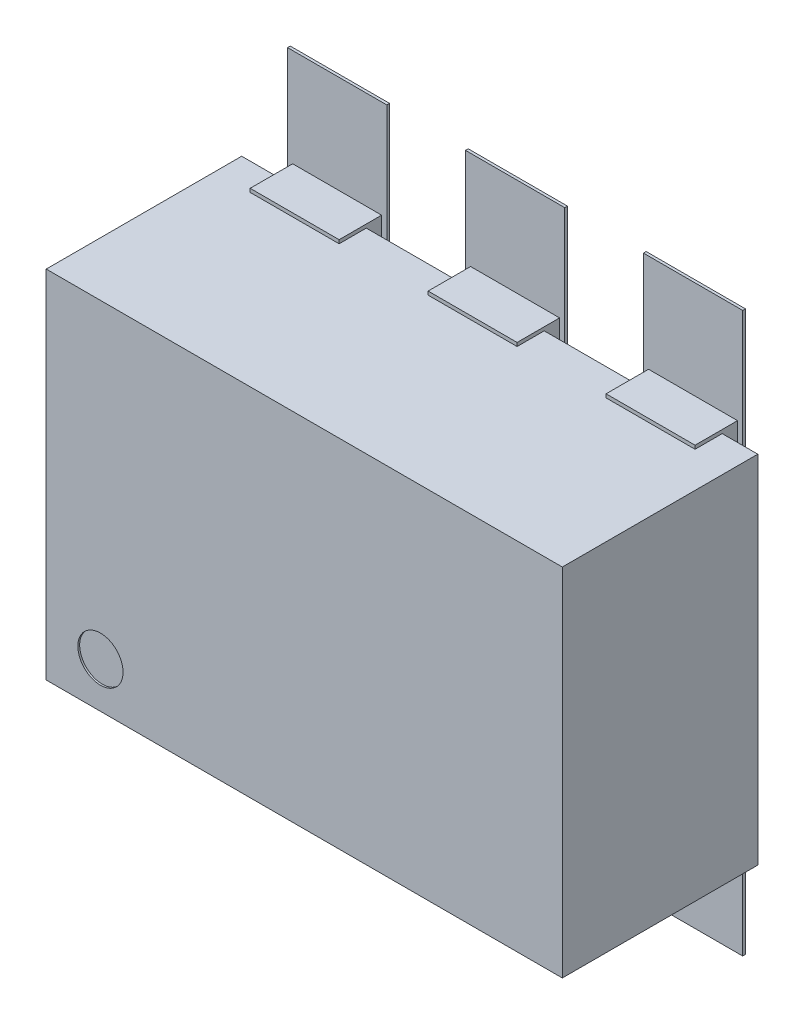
ISO-10303-21;
HEADER;
FILE_DESCRIPTION(('STEP AP214'),'2;1');
FILE_NAME('part.step','',(''),(''),'','','');
FILE_SCHEMA(('AUTOMOTIVE_DESIGN { 1 0 10303 214 1 1 1 1 }'));
ENDSEC;
DATA;
#1=APPLICATION_CONTEXT('core data for automotive mechanical design processes');
#2=APPLICATION_PROTOCOL_DEFINITION('international standard','automotive_design',2000,#1);
#3=PRODUCT_CONTEXT('',#1,'mechanical');
#4=PRODUCT('Part','Part','',(#3));
#5=PRODUCT_RELATED_PRODUCT_CATEGORY('part','',(#4));
#6=PRODUCT_DEFINITION_FORMATION('','',#4);
#7=PRODUCT_DEFINITION_CONTEXT('part definition',#1,'design');
#8=PRODUCT_DEFINITION('design','',#6,#7);
#9=PRODUCT_DEFINITION_SHAPE('','',#8);
#10=(LENGTH_UNIT() NAMED_UNIT(*) SI_UNIT(.MILLI.,.METRE.));
#11=(NAMED_UNIT(*) PLANE_ANGLE_UNIT() SI_UNIT($,.RADIAN.));
#12=(NAMED_UNIT(*) SI_UNIT($,.STERADIAN.) SOLID_ANGLE_UNIT());
#13=UNCERTAINTY_MEASURE_WITH_UNIT(LENGTH_MEASURE(1.E-05),#10,'distance_accuracy_value','');
#14=(GEOMETRIC_REPRESENTATION_CONTEXT(3) GLOBAL_UNCERTAINTY_ASSIGNED_CONTEXT((#13)) GLOBAL_UNIT_ASSIGNED_CONTEXT((#10,
#11,#12)) REPRESENTATION_CONTEXT('',''));
#15=CARTESIAN_POINT('',(0.,0.,0.));
#16=DIRECTION('',(0.,0.,1.));
#17=DIRECTION('',(1.,0.,0.));
#18=AXIS2_PLACEMENT_3D('',#15,#16,#17);
#19=CARTESIAN_POINT('',(0.,0.,0.0762));
#20=DIRECTION('',(0.,0.,1.));
#21=DIRECTION('',(1.,0.,0.));
#22=AXIS2_PLACEMENT_3D('',#19,#20,#21);
#23=PLANE('',#22);
#24=DIRECTION('',(1.,0.,0.));
#25=VECTOR('',#24,1.);
#26=CARTESIAN_POINT('',(0.3605022,0.1124966,0.0762));
#27=LINE('',#26,#25);
#28=CARTESIAN_POINT('',(0.3605022,0.1124966,0.0762));
#29=VERTEX_POINT('',#28);
#30=CARTESIAN_POINT('',(0.6394958,0.1124966,0.0762));
#31=VERTEX_POINT('',#30);
#32=EDGE_CURVE('E413',#29,#31,#27,.T.);
#33=ORIENTED_EDGE('',*,*,#32,.F.);
#34=DIRECTION('',(0.,1.,0.));
#35=VECTOR('',#34,1.);
#36=CARTESIAN_POINT('',(0.3605022,0.785495,0.0762));
#37=LINE('',#36,#35);
#38=CARTESIAN_POINT('',(0.3605022,0.785495,0.0762));
#39=VERTEX_POINT('',#38);
#40=EDGE_CURVE('E418',#39,#29,#37,.F.);
#41=ORIENTED_EDGE('',*,*,#40,.F.);
#42=DIRECTION('',(1.,0.,0.));
#43=VECTOR('',#42,1.);
#44=CARTESIAN_POINT('',(0.6394958,0.785495,0.0762));
#45=LINE('',#44,#43);
#46=CARTESIAN_POINT('',(0.6394958,0.785495,0.0762));
#47=VERTEX_POINT('',#46);
#48=EDGE_CURVE('E444',#47,#39,#45,.F.);
#49=ORIENTED_EDGE('',*,*,#48,.F.);
#50=DIRECTION('',(0.,1.,0.));
#51=VECTOR('',#50,1.);
#52=CARTESIAN_POINT('',(0.6394958,0.1124966,0.0762));
#53=LINE('',#52,#51);
#54=EDGE_CURVE('E428',#31,#47,#53,.T.);
#55=ORIENTED_EDGE('',*,*,#54,.F.);
#56=EDGE_LOOP('',(#33,#41,#49,#55));
#57=FACE_BOUND('',#56,.T.);
#58=ADVANCED_FACE('F16',(#57),#23,.F.);
#59=CARTESIAN_POINT('',(0.,0.,0.0762));
#60=DIRECTION('',(0.,0.,1.));
#61=DIRECTION('',(1.,0.,0.));
#62=AXIS2_PLACEMENT_3D('',#59,#60,#61);
#63=PLANE('',#62);
#64=DIRECTION('',(0.,1.,0.));
#65=VECTOR('',#64,1.);
#66=CARTESIAN_POINT('',(-0.1394968,0.785495,0.0762));
#67=LINE('',#66,#65);
#68=CARTESIAN_POINT('',(-0.1394968,0.785495,0.0762));
#69=VERTEX_POINT('',#68);
#70=CARTESIAN_POINT('',(-0.1394968,0.1124966,0.0762));
#71=VERTEX_POINT('',#70);
#72=EDGE_CURVE('E451',#69,#71,#67,.F.);
#73=ORIENTED_EDGE('',*,*,#72,.F.);
#74=DIRECTION('',(1.,0.,0.));
#75=VECTOR('',#74,1.);
#76=CARTESIAN_POINT('',(0.1394968,0.785495,0.0762));
#77=LINE('',#76,#75);
#78=CARTESIAN_POINT('',(0.1394968,0.785495,0.0762));
#79=VERTEX_POINT('',#78);
#80=EDGE_CURVE('E446',#79,#69,#77,.F.);
#81=ORIENTED_EDGE('',*,*,#80,.F.);
#82=DIRECTION('',(0.,1.,0.));
#83=VECTOR('',#82,1.);
#84=CARTESIAN_POINT('',(0.1394968,0.1124966,0.0762));
#85=LINE('',#84,#83);
#86=CARTESIAN_POINT('',(0.1394968,0.1124966,0.0762));
#87=VERTEX_POINT('',#86);
#88=EDGE_CURVE('E464',#87,#79,#85,.T.);
#89=ORIENTED_EDGE('',*,*,#88,.F.);
#90=DIRECTION('',(1.,0.,0.));
#91=VECTOR('',#90,1.);
#92=CARTESIAN_POINT('',(-0.1394968,0.1124966,0.0762));
#93=LINE('',#92,#91);
#94=EDGE_CURVE('E456',#71,#87,#93,.T.);
#95=ORIENTED_EDGE('',*,*,#94,.F.);
#96=EDGE_LOOP('',(#73,#81,#89,#95));
#97=FACE_BOUND('',#96,.T.);
#98=ADVANCED_FACE('F1246',(#97),#63,.F.);
#99=CARTESIAN_POINT('',(0.,0.,0.0762));
#100=DIRECTION('',(0.,0.,1.));
#101=DIRECTION('',(1.,0.,0.));
#102=AXIS2_PLACEMENT_3D('',#99,#100,#101);
#103=PLANE('',#102);
#104=DIRECTION('',(1.,0.,0.));
#105=VECTOR('',#104,1.);
#106=CARTESIAN_POINT('',(-0.6394958,0.1124966,0.0762));
#107=LINE('',#106,#105);
#108=CARTESIAN_POINT('',(-0.6394958,0.1124966,0.0762));
#109=VERTEX_POINT('',#108);
#110=CARTESIAN_POINT('',(-0.3605022,0.1124966,0.0762));
#111=VERTEX_POINT('',#110);
#112=EDGE_CURVE('E472',#109,#111,#107,.T.);
#113=ORIENTED_EDGE('',*,*,#112,.F.);
#114=DIRECTION('',(0.,1.,0.));
#115=VECTOR('',#114,1.);
#116=CARTESIAN_POINT('',(-0.6394958,0.785495,0.0762));
#117=LINE('',#116,#115);
#118=CARTESIAN_POINT('',(-0.6394958,0.785495,0.0762));
#119=VERTEX_POINT('',#118);
#120=EDGE_CURVE('E467',#119,#109,#117,.F.);
#121=ORIENTED_EDGE('',*,*,#120,.F.);
#122=DIRECTION('',(1.,0.,0.));
#123=VECTOR('',#122,1.);
#124=CARTESIAN_POINT('',(-0.3605022,0.785495,0.0762));
#125=LINE('',#124,#123);
#126=CARTESIAN_POINT('',(-0.3605022,0.785495,0.0762));
#127=VERTEX_POINT('',#126);
#128=EDGE_CURVE('E485',#127,#119,#125,.F.);
#129=ORIENTED_EDGE('',*,*,#128,.F.);
#130=DIRECTION('',(0.,1.,0.));
#131=VECTOR('',#130,1.);
#132=CARTESIAN_POINT('',(-0.3605022,0.1124966,0.0762));
#133=LINE('',#132,#131);
#134=EDGE_CURVE('E477',#111,#127,#133,.T.);
#135=ORIENTED_EDGE('',*,*,#134,.F.);
#136=EDGE_LOOP('',(#113,#121,#129,#135));
#137=FACE_BOUND('',#136,.T.);
#138=ADVANCED_FACE('F1243',(#137),#103,.F.);
#139=CARTESIAN_POINT('',(0.,0.,0.0762));
#140=DIRECTION('',(0.,0.,1.));
#141=DIRECTION('',(1.,0.,0.));
#142=AXIS2_PLACEMENT_3D('',#139,#140,#141);
#143=PLANE('',#142);
#144=DIRECTION('',(0.,1.,0.));
#145=VECTOR('',#144,1.);
#146=CARTESIAN_POINT('',(0.1394968,-0.785495,0.0762));
#147=LINE('',#146,#145);
#148=CARTESIAN_POINT('',(0.1394968,-0.785495,0.0762));
#149=VERTEX_POINT('',#148);
#150=CARTESIAN_POINT('',(0.1394968,-0.1124966,0.0762));
#151=VERTEX_POINT('',#150);
#152=EDGE_CURVE('E493',#149,#151,#147,.T.);
#153=ORIENTED_EDGE('',*,*,#152,.F.);
#154=DIRECTION('',(1.,0.,0.));
#155=VECTOR('',#154,1.);
#156=CARTESIAN_POINT('',(-0.1394968,-0.785495,0.0762));
#157=LINE('',#156,#155);
#158=CARTESIAN_POINT('',(-0.1394968,-0.785495,0.0762));
#159=VERTEX_POINT('',#158);
#160=EDGE_CURVE('E488',#159,#149,#157,.T.);
#161=ORIENTED_EDGE('',*,*,#160,.F.);
#162=DIRECTION('',(0.,1.,0.));
#163=VECTOR('',#162,1.);
#164=CARTESIAN_POINT('',(-0.1394968,-0.1124966,0.0762));
#165=LINE('',#164,#163);
#166=CARTESIAN_POINT('',(-0.1394968,-0.1124966,0.0762));
#167=VERTEX_POINT('',#166);
#168=EDGE_CURVE('E506',#167,#159,#165,.F.);
#169=ORIENTED_EDGE('',*,*,#168,.F.);
#170=DIRECTION('',(1.,0.,0.));
#171=VECTOR('',#170,1.);
#172=CARTESIAN_POINT('',(0.1394968,-0.1124966,0.0762));
#173=LINE('',#172,#171);
#174=EDGE_CURVE('E498',#151,#167,#173,.F.);
#175=ORIENTED_EDGE('',*,*,#174,.F.);
#176=EDGE_LOOP('',(#153,#161,#169,#175));
#177=FACE_BOUND('',#176,.T.);
#178=ADVANCED_FACE('F1239',(#177),#143,.F.);
#179=CARTESIAN_POINT('',(0.,0.,0.0762));
#180=DIRECTION('',(0.,0.,1.));
#181=DIRECTION('',(1.,0.,0.));
#182=AXIS2_PLACEMENT_3D('',#179,#180,#181);
#183=PLANE('',#182);
#184=DIRECTION('',(1.,0.,0.));
#185=VECTOR('',#184,1.);
#186=CARTESIAN_POINT('',(0.6394958,-0.1124966,0.0762));
#187=LINE('',#186,#185);
#188=CARTESIAN_POINT('',(0.6394958,-0.1124966,0.0762));
#189=VERTEX_POINT('',#188);
#190=CARTESIAN_POINT('',(0.3605022,-0.1124966,0.0762));
#191=VERTEX_POINT('',#190);
#192=EDGE_CURVE('E514',#189,#191,#187,.F.);
#193=ORIENTED_EDGE('',*,*,#192,.F.);
#194=DIRECTION('',(0.,1.,0.));
#195=VECTOR('',#194,1.);
#196=CARTESIAN_POINT('',(0.6394958,-0.785495,0.0762));
#197=LINE('',#196,#195);
#198=CARTESIAN_POINT('',(0.6394958,-0.785495,0.0762));
#199=VERTEX_POINT('',#198);
#200=EDGE_CURVE('E509',#199,#189,#197,.T.);
#201=ORIENTED_EDGE('',*,*,#200,.F.);
#202=DIRECTION('',(1.,0.,0.));
#203=VECTOR('',#202,1.);
#204=CARTESIAN_POINT('',(0.3605022,-0.785495,0.0762));
#205=LINE('',#204,#203);
#206=CARTESIAN_POINT('',(0.3605022,-0.785495,0.0762));
#207=VERTEX_POINT('',#206);
#208=EDGE_CURVE('E527',#207,#199,#205,.T.);
#209=ORIENTED_EDGE('',*,*,#208,.F.);
#210=DIRECTION('',(0.,1.,0.));
#211=VECTOR('',#210,1.);
#212=CARTESIAN_POINT('',(0.3605022,-0.1124966,0.0762));
#213=LINE('',#212,#211);
#214=EDGE_CURVE('E519',#191,#207,#213,.F.);
#215=ORIENTED_EDGE('',*,*,#214,.F.);
#216=EDGE_LOOP('',(#193,#201,#209,#215));
#217=FACE_BOUND('',#216,.T.);
#218=ADVANCED_FACE('F1235',(#217),#183,.F.);
#219=CARTESIAN_POINT('',(0.,0.,0.0762));
#220=DIRECTION('',(0.,0.,1.));
#221=DIRECTION('',(1.,0.,0.));
#222=AXIS2_PLACEMENT_3D('',#219,#220,#221);
#223=PLANE('',#222);
#224=DIRECTION('',(1.,0.,0.));
#225=VECTOR('',#224,1.);
#226=CARTESIAN_POINT('',(-0.3605022,-0.1124966,0.0762));
#227=LINE('',#226,#225);
#228=CARTESIAN_POINT('',(-0.3605022,-0.1124966,0.0762));
#229=VERTEX_POINT('',#228);
#230=CARTESIAN_POINT('',(-0.6394958,-0.1124966,0.0762));
#231=VERTEX_POINT('',#230);
#232=EDGE_CURVE('E535',#229,#231,#227,.F.);
#233=ORIENTED_EDGE('',*,*,#232,.F.);
#234=DIRECTION('',(0.,1.,0.));
#235=VECTOR('',#234,1.);
#236=CARTESIAN_POINT('',(-0.3605022,-0.785495,0.0762));
#237=LINE('',#236,#235);
#238=CARTESIAN_POINT('',(-0.3605022,-0.785495,0.0762));
#239=VERTEX_POINT('',#238);
#240=EDGE_CURVE('E530',#239,#229,#237,.T.);
#241=ORIENTED_EDGE('',*,*,#240,.F.);
#242=DIRECTION('',(1.,0.,0.));
#243=VECTOR('',#242,1.);
#244=CARTESIAN_POINT('',(-0.6394958,-0.785495,0.0762));
#245=LINE('',#244,#243);
#246=CARTESIAN_POINT('',(-0.6394958,-0.785495,0.0762));
#247=VERTEX_POINT('',#246);
#248=EDGE_CURVE('E548',#247,#239,#245,.T.);
#249=ORIENTED_EDGE('',*,*,#248,.F.);
#250=DIRECTION('',(0.,1.,0.));
#251=VECTOR('',#250,1.);
#252=CARTESIAN_POINT('',(-0.6394958,-0.1124966,0.0762));
#253=LINE('',#252,#251);
#254=EDGE_CURVE('E540',#231,#247,#253,.F.);
#255=ORIENTED_EDGE('',*,*,#254,.F.);
#256=EDGE_LOOP('',(#233,#241,#249,#255));
#257=FACE_BOUND('',#256,.T.);
#258=ADVANCED_FACE('F1232',(#257),#223,.F.);
#259=CARTESIAN_POINT('',(0.3605022,0.785495,0.0762));
#260=DIRECTION('',(-1.,0.,0.));
#261=DIRECTION('',(0.,0.,1.));
#262=AXIS2_PLACEMENT_3D('',#259,#260,#261);
#263=PLANE('',#262);
#264=DIRECTION('',(0.,0.,1.));
#265=VECTOR('',#264,1.);
#266=CARTESIAN_POINT('',(0.3605022,0.785495,0.0762));
#267=LINE('',#266,#265);
#268=CARTESIAN_POINT('',(0.3605022,0.785495,0.08382));
#269=VERTEX_POINT('',#268);
#270=EDGE_CURVE('E423',#39,#269,#267,.T.);
#271=ORIENTED_EDGE('',*,*,#270,.F.);
#272=ORIENTED_EDGE('',*,*,#40,.T.);
#273=DIRECTION('',(0.,0.,-1.));
#274=VECTOR('',#273,1.);
#275=CARTESIAN_POINT('',(0.3605022,0.1124966,0.0762));
#276=LINE('',#275,#274);
#277=CARTESIAN_POINT('',(0.3605022,0.1124966,0.08382));
#278=VERTEX_POINT('',#277);
#279=EDGE_CURVE('E420',#278,#29,#276,.T.);
#280=ORIENTED_EDGE('',*,*,#279,.F.);
#281=DIRECTION('',(0.,1.,0.));
#282=VECTOR('',#281,1.);
#283=CARTESIAN_POINT('',(0.3605022,0.,0.08382));
#284=LINE('',#283,#282);
#285=EDGE_CURVE('E551',#269,#278,#284,.F.);
#286=ORIENTED_EDGE('',*,*,#285,.F.);
#287=EDGE_LOOP('',(#271,#272,#280,#286));
#288=FACE_BOUND('',#287,.T.);
#289=ADVANCED_FACE('F419',(#288),#263,.T.);
#290=CARTESIAN_POINT('',(0.3605022,0.1124966,0.0762));
#291=DIRECTION('',(0.,-1.,0.));
#292=DIRECTION('',(0.,0.,-1.));
#293=AXIS2_PLACEMENT_3D('',#290,#291,#292);
#294=PLANE('',#293);
#295=ORIENTED_EDGE('',*,*,#279,.T.);
#296=ORIENTED_EDGE('',*,*,#32,.T.);
#297=DIRECTION('',(0.,0.,-1.));
#298=VECTOR('',#297,1.);
#299=CARTESIAN_POINT('',(0.6394958,0.1124966,0.0762));
#300=LINE('',#299,#298);
#301=CARTESIAN_POINT('',(0.6394958,0.1124966,0.08382));
#302=VERTEX_POINT('',#301);
#303=EDGE_CURVE('E430',#302,#31,#300,.T.);
#304=ORIENTED_EDGE('',*,*,#303,.F.);
#305=DIRECTION('',(1.,0.,0.));
#306=VECTOR('',#305,1.);
#307=CARTESIAN_POINT('',(0.,0.1124966,0.08382));
#308=LINE('',#307,#306);
#309=EDGE_CURVE('E434',#278,#302,#308,.T.);
#310=ORIENTED_EDGE('',*,*,#309,.F.);
#311=EDGE_LOOP('',(#295,#296,#304,#310));
#312=FACE_BOUND('',#311,.T.);
#313=ADVANCED_FACE('F432',(#312),#294,.T.);
#314=CARTESIAN_POINT('',(0.6394958,0.1124966,0.0762));
#315=DIRECTION('',(1.,0.,0.));
#316=DIRECTION('',(0.,0.,-1.));
#317=AXIS2_PLACEMENT_3D('',#314,#315,#316);
#318=PLANE('',#317);
#319=ORIENTED_EDGE('',*,*,#303,.T.);
#320=ORIENTED_EDGE('',*,*,#54,.T.);
#321=DIRECTION('',(0.,0.,1.));
#322=VECTOR('',#321,1.);
#323=CARTESIAN_POINT('',(0.6394958,0.785495,0.0762));
#324=LINE('',#323,#322);
#325=CARTESIAN_POINT('',(0.6394958,0.785495,0.08382));
#326=VERTEX_POINT('',#325);
#327=EDGE_CURVE('E441',#326,#47,#324,.F.);
#328=ORIENTED_EDGE('',*,*,#327,.F.);
#329=DIRECTION('',(0.,1.,0.));
#330=VECTOR('',#329,1.);
#331=CARTESIAN_POINT('',(0.6394958,0.,0.08382));
#332=LINE('',#331,#330);
#333=EDGE_CURVE('E554',#302,#326,#332,.T.);
#334=ORIENTED_EDGE('',*,*,#333,.F.);
#335=EDGE_LOOP('',(#319,#320,#328,#334));
#336=FACE_BOUND('',#335,.T.);
#337=ADVANCED_FACE('F1223',(#336),#318,.T.);
#338=CARTESIAN_POINT('',(0.6394958,0.785495,0.0762));
#339=DIRECTION('',(0.,1.,0.));
#340=DIRECTION('',(0.,0.,1.));
#341=AXIS2_PLACEMENT_3D('',#338,#339,#340);
#342=PLANE('',#341);
#343=ORIENTED_EDGE('',*,*,#327,.T.);
#344=ORIENTED_EDGE('',*,*,#48,.T.);
#345=ORIENTED_EDGE('',*,*,#270,.T.);
#346=DIRECTION('',(1.,0.,0.));
#347=VECTOR('',#346,1.);
#348=CARTESIAN_POINT('',(0.,0.785495,0.08382));
#349=LINE('',#348,#347);
#350=EDGE_CURVE('E557',#326,#269,#349,.F.);
#351=ORIENTED_EDGE('',*,*,#350,.F.);
#352=EDGE_LOOP('',(#343,#344,#345,#351));
#353=FACE_BOUND('',#352,.T.);
#354=ADVANCED_FACE('F1219',(#353),#342,.T.);
#355=CARTESIAN_POINT('',(0.1394968,0.785495,0.0762));
#356=DIRECTION('',(0.,1.,0.));
#357=DIRECTION('',(0.,0.,1.));
#358=AXIS2_PLACEMENT_3D('',#355,#356,#357);
#359=PLANE('',#358);
#360=DIRECTION('',(0.,0.,-1.));
#361=VECTOR('',#360,1.);
#362=CARTESIAN_POINT('',(0.1394968,0.785495,0.0762));
#363=LINE('',#362,#361);
#364=CARTESIAN_POINT('',(0.1394968,0.785495,0.08382));
#365=VERTEX_POINT('',#364);
#366=EDGE_CURVE('E458',#79,#365,#363,.F.);
#367=ORIENTED_EDGE('',*,*,#366,.F.);
#368=ORIENTED_EDGE('',*,*,#80,.T.);
#369=DIRECTION('',(0.,0.,1.));
#370=VECTOR('',#369,1.);
#371=CARTESIAN_POINT('',(-0.1394968,0.785495,0.0762));
#372=LINE('',#371,#370);
#373=CARTESIAN_POINT('',(-0.1394968,0.785495,0.08382));
#374=VERTEX_POINT('',#373);
#375=EDGE_CURVE('E448',#374,#69,#372,.F.);
#376=ORIENTED_EDGE('',*,*,#375,.F.);
#377=DIRECTION('',(1.,0.,0.));
#378=VECTOR('',#377,1.);
#379=CARTESIAN_POINT('',(0.,0.785495,0.08382));
#380=LINE('',#379,#378);
#381=EDGE_CURVE('E563',#365,#374,#380,.F.);
#382=ORIENTED_EDGE('',*,*,#381,.F.);
#383=EDGE_LOOP('',(#367,#368,#376,#382));
#384=FACE_BOUND('',#383,.T.);
#385=ADVANCED_FACE('F1215',(#384),#359,.T.);
#386=CARTESIAN_POINT('',(-0.1394968,0.785495,0.0762));
#387=DIRECTION('',(-1.,0.,0.));
#388=DIRECTION('',(0.,0.,1.));
#389=AXIS2_PLACEMENT_3D('',#386,#387,#388);
#390=PLANE('',#389);
#391=ORIENTED_EDGE('',*,*,#375,.T.);
#392=ORIENTED_EDGE('',*,*,#72,.T.);
#393=DIRECTION('',(0.,0.,-1.));
#394=VECTOR('',#393,1.);
#395=CARTESIAN_POINT('',(-0.1394968,0.1124966,0.0762));
#396=LINE('',#395,#394);
#397=CARTESIAN_POINT('',(-0.1394968,0.1124966,0.08382));
#398=VERTEX_POINT('',#397);
#399=EDGE_CURVE('E453',#398,#71,#396,.T.);
#400=ORIENTED_EDGE('',*,*,#399,.F.);
#401=DIRECTION('',(0.,1.,0.));
#402=VECTOR('',#401,1.);
#403=CARTESIAN_POINT('',(-0.1394968,0.,0.08382));
#404=LINE('',#403,#402);
#405=EDGE_CURVE('E566',#374,#398,#404,.F.);
#406=ORIENTED_EDGE('',*,*,#405,.F.);
#407=EDGE_LOOP('',(#391,#392,#400,#406));
#408=FACE_BOUND('',#407,.T.);
#409=ADVANCED_FACE('F1211',(#408),#390,.T.);
#410=CARTESIAN_POINT('',(-0.1394968,0.1124966,0.0762));
#411=DIRECTION('',(0.,-1.,0.));
#412=DIRECTION('',(0.,0.,-1.));
#413=AXIS2_PLACEMENT_3D('',#410,#411,#412);
#414=PLANE('',#413);
#415=ORIENTED_EDGE('',*,*,#399,.T.);
#416=ORIENTED_EDGE('',*,*,#94,.T.);
#417=DIRECTION('',(0.,0.,-1.));
#418=VECTOR('',#417,1.);
#419=CARTESIAN_POINT('',(0.1394968,0.1124966,0.0762));
#420=LINE('',#419,#418);
#421=CARTESIAN_POINT('',(0.1394968,0.1124966,0.08382));
#422=VERTEX_POINT('',#421);
#423=EDGE_CURVE('E461',#422,#87,#420,.T.);
#424=ORIENTED_EDGE('',*,*,#423,.F.);
#425=DIRECTION('',(1.,0.,0.));
#426=VECTOR('',#425,1.);
#427=CARTESIAN_POINT('',(0.,0.1124966,0.08382));
#428=LINE('',#427,#426);
#429=EDGE_CURVE('E569',#398,#422,#428,.T.);
#430=ORIENTED_EDGE('',*,*,#429,.F.);
#431=EDGE_LOOP('',(#415,#416,#424,#430));
#432=FACE_BOUND('',#431,.T.);
#433=ADVANCED_FACE('F1207',(#432),#414,.T.);
#434=CARTESIAN_POINT('',(0.1394968,0.1124966,0.0762));
#435=DIRECTION('',(1.,0.,0.));
#436=DIRECTION('',(0.,0.,-1.));
#437=AXIS2_PLACEMENT_3D('',#434,#435,#436);
#438=PLANE('',#437);
#439=ORIENTED_EDGE('',*,*,#423,.T.);
#440=ORIENTED_EDGE('',*,*,#88,.T.);
#441=ORIENTED_EDGE('',*,*,#366,.T.);
#442=DIRECTION('',(0.,1.,0.));
#443=VECTOR('',#442,1.);
#444=CARTESIAN_POINT('',(0.1394968,0.,0.08382));
#445=LINE('',#444,#443);
#446=EDGE_CURVE('E572',#422,#365,#445,.T.);
#447=ORIENTED_EDGE('',*,*,#446,.F.);
#448=EDGE_LOOP('',(#439,#440,#441,#447));
#449=FACE_BOUND('',#448,.T.);
#450=ADVANCED_FACE('F1203',(#449),#438,.T.);
#451=CARTESIAN_POINT('',(-0.6394958,0.785495,0.0762));
#452=DIRECTION('',(-1.,0.,0.));
#453=DIRECTION('',(0.,0.,1.));
#454=AXIS2_PLACEMENT_3D('',#451,#452,#453);
#455=PLANE('',#454);
#456=DIRECTION('',(0.,0.,1.));
#457=VECTOR('',#456,1.);
#458=CARTESIAN_POINT('',(-0.6394958,0.785495,0.0762));
#459=LINE('',#458,#457);
#460=CARTESIAN_POINT('',(-0.6394958,0.785495,0.08382));
#461=VERTEX_POINT('',#460);
#462=EDGE_CURVE('E479',#119,#461,#459,.T.);
#463=ORIENTED_EDGE('',*,*,#462,.F.);
#464=ORIENTED_EDGE('',*,*,#120,.T.);
#465=DIRECTION('',(0.,0.,-1.));
#466=VECTOR('',#465,1.);
#467=CARTESIAN_POINT('',(-0.6394958,0.1124966,0.0762));
#468=LINE('',#467,#466);
#469=CARTESIAN_POINT('',(-0.6394958,0.1124966,0.08382));
#470=VERTEX_POINT('',#469);
#471=EDGE_CURVE('E469',#470,#109,#468,.T.);
#472=ORIENTED_EDGE('',*,*,#471,.F.);
#473=DIRECTION('',(0.,1.,0.));
#474=VECTOR('',#473,1.);
#475=CARTESIAN_POINT('',(-0.6394958,0.,0.08382));
#476=LINE('',#475,#474);
#477=EDGE_CURVE('E578',#461,#470,#476,.F.);
#478=ORIENTED_EDGE('',*,*,#477,.F.);
#479=EDGE_LOOP('',(#463,#464,#472,#478));
#480=FACE_BOUND('',#479,.T.);
#481=ADVANCED_FACE('F1199',(#480),#455,.T.);
#482=CARTESIAN_POINT('',(-0.6394958,0.1124966,0.0762));
#483=DIRECTION('',(0.,-1.,0.));
#484=DIRECTION('',(0.,0.,-1.));
#485=AXIS2_PLACEMENT_3D('',#482,#483,#484);
#486=PLANE('',#485);
#487=ORIENTED_EDGE('',*,*,#471,.T.);
#488=ORIENTED_EDGE('',*,*,#112,.T.);
#489=DIRECTION('',(0.,0.,-1.));
#490=VECTOR('',#489,1.);
#491=CARTESIAN_POINT('',(-0.3605022,0.1124966,0.0762));
#492=LINE('',#491,#490);
#493=CARTESIAN_POINT('',(-0.3605022,0.1124966,0.08382));
#494=VERTEX_POINT('',#493);
#495=EDGE_CURVE('E474',#494,#111,#492,.T.);
#496=ORIENTED_EDGE('',*,*,#495,.F.);
#497=DIRECTION('',(1.,0.,0.));
#498=VECTOR('',#497,1.);
#499=CARTESIAN_POINT('',(0.,0.1124966,0.08382));
#500=LINE('',#499,#498);
#501=EDGE_CURVE('E581',#470,#494,#500,.T.);
#502=ORIENTED_EDGE('',*,*,#501,.F.);
#503=EDGE_LOOP('',(#487,#488,#496,#502));
#504=FACE_BOUND('',#503,.T.);
#505=ADVANCED_FACE('F1195',(#504),#486,.T.);
#506=CARTESIAN_POINT('',(-0.3605022,0.1124966,0.0762));
#507=DIRECTION('',(1.,0.,0.));
#508=DIRECTION('',(0.,0.,-1.));
#509=AXIS2_PLACEMENT_3D('',#506,#507,#508);
#510=PLANE('',#509);
#511=ORIENTED_EDGE('',*,*,#495,.T.);
#512=ORIENTED_EDGE('',*,*,#134,.T.);
#513=DIRECTION('',(0.,0.,1.));
#514=VECTOR('',#513,1.);
#515=CARTESIAN_POINT('',(-0.3605022,0.785495,0.0762));
#516=LINE('',#515,#514);
#517=CARTESIAN_POINT('',(-0.3605022,0.785495,0.08382));
#518=VERTEX_POINT('',#517);
#519=EDGE_CURVE('E482',#518,#127,#516,.F.);
#520=ORIENTED_EDGE('',*,*,#519,.F.);
#521=DIRECTION('',(0.,1.,0.));
#522=VECTOR('',#521,1.);
#523=CARTESIAN_POINT('',(-0.3605022,0.,0.08382));
#524=LINE('',#523,#522);
#525=EDGE_CURVE('E584',#494,#518,#524,.T.);
#526=ORIENTED_EDGE('',*,*,#525,.F.);
#527=EDGE_LOOP('',(#511,#512,#520,#526));
#528=FACE_BOUND('',#527,.T.);
#529=ADVANCED_FACE('F1191',(#528),#510,.T.);
#530=CARTESIAN_POINT('',(-0.3605022,0.785495,0.0762));
#531=DIRECTION('',(0.,1.,0.));
#532=DIRECTION('',(0.,0.,1.));
#533=AXIS2_PLACEMENT_3D('',#530,#531,#532);
#534=PLANE('',#533);
#535=ORIENTED_EDGE('',*,*,#519,.T.);
#536=ORIENTED_EDGE('',*,*,#128,.T.);
#537=ORIENTED_EDGE('',*,*,#462,.T.);
#538=DIRECTION('',(1.,0.,0.));
#539=VECTOR('',#538,1.);
#540=CARTESIAN_POINT('',(0.,0.785495,0.08382));
#541=LINE('',#540,#539);
#542=EDGE_CURVE('E587',#518,#461,#541,.F.);
#543=ORIENTED_EDGE('',*,*,#542,.F.);
#544=EDGE_LOOP('',(#535,#536,#537,#543));
#545=FACE_BOUND('',#544,.T.);
#546=ADVANCED_FACE('F1187',(#545),#534,.T.);
#547=CARTESIAN_POINT('',(-0.1394968,-0.785495,0.0762));
#548=DIRECTION('',(0.,-1.,0.));
#549=DIRECTION('',(0.,0.,-1.));
#550=AXIS2_PLACEMENT_3D('',#547,#548,#549);
#551=PLANE('',#550);
#552=DIRECTION('',(0.,0.,1.));
#553=VECTOR('',#552,1.);
#554=CARTESIAN_POINT('',(-0.1394968,-0.785495,0.0762));
#555=LINE('',#554,#553);
#556=CARTESIAN_POINT('',(-0.1394968,-0.785495,0.08382));
#557=VERTEX_POINT('',#556);
#558=EDGE_CURVE('E500',#159,#557,#555,.T.);
#559=ORIENTED_EDGE('',*,*,#558,.F.);
#560=ORIENTED_EDGE('',*,*,#160,.T.);
#561=DIRECTION('',(0.,0.,-1.));
#562=VECTOR('',#561,1.);
#563=CARTESIAN_POINT('',(0.1394968,-0.785495,0.0762));
#564=LINE('',#563,#562);
#565=CARTESIAN_POINT('',(0.1394968,-0.785495,0.08382));
#566=VERTEX_POINT('',#565);
#567=EDGE_CURVE('E490',#566,#149,#564,.T.);
#568=ORIENTED_EDGE('',*,*,#567,.F.);
#569=DIRECTION('',(1.,0.,0.));
#570=VECTOR('',#569,1.);
#571=CARTESIAN_POINT('',(0.,-0.785495,0.08382));
#572=LINE('',#571,#570);
#573=EDGE_CURVE('E592',#557,#566,#572,.T.);
#574=ORIENTED_EDGE('',*,*,#573,.F.);
#575=EDGE_LOOP('',(#559,#560,#568,#574));
#576=FACE_BOUND('',#575,.T.);
#577=ADVANCED_FACE('F1183',(#576),#551,.T.);
#578=CARTESIAN_POINT('',(0.1394968,-0.785495,0.0762));
#579=DIRECTION('',(1.,0.,0.));
#580=DIRECTION('',(0.,0.,-1.));
#581=AXIS2_PLACEMENT_3D('',#578,#579,#580);
#582=PLANE('',#581);
#583=ORIENTED_EDGE('',*,*,#567,.T.);
#584=ORIENTED_EDGE('',*,*,#152,.T.);
#585=DIRECTION('',(0.,0.,1.));
#586=VECTOR('',#585,1.);
#587=CARTESIAN_POINT('',(0.1394968,-0.1124966,0.0762));
#588=LINE('',#587,#586);
#589=CARTESIAN_POINT('',(0.1394968,-0.1124966,0.08382));
#590=VERTEX_POINT('',#589);
#591=EDGE_CURVE('E495',#590,#151,#588,.F.);
#592=ORIENTED_EDGE('',*,*,#591,.F.);
#593=DIRECTION('',(0.,1.,0.));
#594=VECTOR('',#593,1.);
#595=CARTESIAN_POINT('',(0.1394968,0.,0.08382));
#596=LINE('',#595,#594);
#597=EDGE_CURVE('E595',#566,#590,#596,.T.);
#598=ORIENTED_EDGE('',*,*,#597,.F.);
#599=EDGE_LOOP('',(#583,#584,#592,#598));
#600=FACE_BOUND('',#599,.T.);
#601=ADVANCED_FACE('F1179',(#600),#582,.T.);
#602=CARTESIAN_POINT('',(0.1394968,-0.1124966,0.0762));
#603=DIRECTION('',(0.,1.,0.));
#604=DIRECTION('',(0.,0.,1.));
#605=AXIS2_PLACEMENT_3D('',#602,#603,#604);
#606=PLANE('',#605);
#607=ORIENTED_EDGE('',*,*,#591,.T.);
#608=ORIENTED_EDGE('',*,*,#174,.T.);
#609=DIRECTION('',(0.,0.,1.));
#610=VECTOR('',#609,1.);
#611=CARTESIAN_POINT('',(-0.1394968,-0.1124966,0.0762));
#612=LINE('',#611,#610);
#613=CARTESIAN_POINT('',(-0.1394968,-0.1124966,0.08382));
#614=VERTEX_POINT('',#613);
#615=EDGE_CURVE('E503',#614,#167,#612,.F.);
#616=ORIENTED_EDGE('',*,*,#615,.F.);
#617=DIRECTION('',(1.,0.,0.));
#618=VECTOR('',#617,1.);
#619=CARTESIAN_POINT('',(0.,-0.1124966,0.08382));
#620=LINE('',#619,#618);
#621=EDGE_CURVE('E598',#590,#614,#620,.F.);
#622=ORIENTED_EDGE('',*,*,#621,.F.);
#623=EDGE_LOOP('',(#607,#608,#616,#622));
#624=FACE_BOUND('',#623,.T.);
#625=ADVANCED_FACE('F1175',(#624),#606,.T.);
#626=CARTESIAN_POINT('',(-0.1394968,-0.1124966,0.0762));
#627=DIRECTION('',(-1.,0.,0.));
#628=DIRECTION('',(0.,0.,1.));
#629=AXIS2_PLACEMENT_3D('',#626,#627,#628);
#630=PLANE('',#629);
#631=ORIENTED_EDGE('',*,*,#615,.T.);
#632=ORIENTED_EDGE('',*,*,#168,.T.);
#633=ORIENTED_EDGE('',*,*,#558,.T.);
#634=DIRECTION('',(0.,1.,0.));
#635=VECTOR('',#634,1.);
#636=CARTESIAN_POINT('',(-0.1394968,0.,0.08382));
#637=LINE('',#636,#635);
#638=EDGE_CURVE('E601',#614,#557,#637,.F.);
#639=ORIENTED_EDGE('',*,*,#638,.F.);
#640=EDGE_LOOP('',(#631,#632,#633,#639));
#641=FACE_BOUND('',#640,.T.);
#642=ADVANCED_FACE('F1171',(#641),#630,.T.);
#643=CARTESIAN_POINT('',(0.6394958,-0.785495,0.0762));
#644=DIRECTION('',(1.,0.,0.));
#645=DIRECTION('',(0.,0.,-1.));
#646=AXIS2_PLACEMENT_3D('',#643,#644,#645);
#647=PLANE('',#646);
#648=DIRECTION('',(0.,0.,-1.));
#649=VECTOR('',#648,1.);
#650=CARTESIAN_POINT('',(0.6394958,-0.785495,0.0762));
#651=LINE('',#650,#649);
#652=CARTESIAN_POINT('',(0.6394958,-0.785495,0.08382));
#653=VERTEX_POINT('',#652);
#654=EDGE_CURVE('E521',#199,#653,#651,.F.);
#655=ORIENTED_EDGE('',*,*,#654,.F.);
#656=ORIENTED_EDGE('',*,*,#200,.T.);
#657=DIRECTION('',(0.,0.,1.));
#658=VECTOR('',#657,1.);
#659=CARTESIAN_POINT('',(0.6394958,-0.1124966,0.0762));
#660=LINE('',#659,#658);
#661=CARTESIAN_POINT('',(0.6394958,-0.1124966,0.08382));
#662=VERTEX_POINT('',#661);
#663=EDGE_CURVE('E511',#662,#189,#660,.F.);
#664=ORIENTED_EDGE('',*,*,#663,.F.);
#665=DIRECTION('',(0.,1.,0.));
#666=VECTOR('',#665,1.);
#667=CARTESIAN_POINT('',(0.6394958,0.,0.08382));
#668=LINE('',#667,#666);
#669=EDGE_CURVE('E607',#653,#662,#668,.T.);
#670=ORIENTED_EDGE('',*,*,#669,.F.);
#671=EDGE_LOOP('',(#655,#656,#664,#670));
#672=FACE_BOUND('',#671,.T.);
#673=ADVANCED_FACE('F1167',(#672),#647,.T.);
#674=CARTESIAN_POINT('',(0.6394958,-0.1124966,0.0762));
#675=DIRECTION('',(0.,1.,0.));
#676=DIRECTION('',(0.,0.,1.));
#677=AXIS2_PLACEMENT_3D('',#674,#675,#676);
#678=PLANE('',#677);
#679=ORIENTED_EDGE('',*,*,#663,.T.);
#680=ORIENTED_EDGE('',*,*,#192,.T.);
#681=DIRECTION('',(0.,0.,1.));
#682=VECTOR('',#681,1.);
#683=CARTESIAN_POINT('',(0.3605022,-0.1124966,0.0762));
#684=LINE('',#683,#682);
#685=CARTESIAN_POINT('',(0.3605022,-0.1124966,0.08382));
#686=VERTEX_POINT('',#685);
#687=EDGE_CURVE('E516',#686,#191,#684,.F.);
#688=ORIENTED_EDGE('',*,*,#687,.F.);
#689=DIRECTION('',(1.,0.,0.));
#690=VECTOR('',#689,1.);
#691=CARTESIAN_POINT('',(0.,-0.1124966,0.08382));
#692=LINE('',#691,#690);
#693=EDGE_CURVE('E610',#662,#686,#692,.F.);
#694=ORIENTED_EDGE('',*,*,#693,.F.);
#695=EDGE_LOOP('',(#679,#680,#688,#694));
#696=FACE_BOUND('',#695,.T.);
#697=ADVANCED_FACE('F1163',(#696),#678,.T.);
#698=CARTESIAN_POINT('',(0.3605022,-0.1124966,0.0762));
#699=DIRECTION('',(-1.,0.,0.));
#700=DIRECTION('',(0.,0.,1.));
#701=AXIS2_PLACEMENT_3D('',#698,#699,#700);
#702=PLANE('',#701);
#703=ORIENTED_EDGE('',*,*,#687,.T.);
#704=ORIENTED_EDGE('',*,*,#214,.T.);
#705=DIRECTION('',(0.,0.,-1.));
#706=VECTOR('',#705,1.);
#707=CARTESIAN_POINT('',(0.3605022,-0.785495,0.0762));
#708=LINE('',#707,#706);
#709=CARTESIAN_POINT('',(0.3605022,-0.785495,0.08382));
#710=VERTEX_POINT('',#709);
#711=EDGE_CURVE('E524',#710,#207,#708,.T.);
#712=ORIENTED_EDGE('',*,*,#711,.F.);
#713=DIRECTION('',(0.,1.,0.));
#714=VECTOR('',#713,1.);
#715=CARTESIAN_POINT('',(0.3605022,0.,0.08382));
#716=LINE('',#715,#714);
#717=EDGE_CURVE('E613',#686,#710,#716,.F.);
#718=ORIENTED_EDGE('',*,*,#717,.F.);
#719=EDGE_LOOP('',(#703,#704,#712,#718));
#720=FACE_BOUND('',#719,.T.);
#721=ADVANCED_FACE('F1159',(#720),#702,.T.);
#722=CARTESIAN_POINT('',(0.3605022,-0.785495,0.0762));
#723=DIRECTION('',(0.,-1.,0.));
#724=DIRECTION('',(0.,0.,-1.));
#725=AXIS2_PLACEMENT_3D('',#722,#723,#724);
#726=PLANE('',#725);
#727=ORIENTED_EDGE('',*,*,#711,.T.);
#728=ORIENTED_EDGE('',*,*,#208,.T.);
#729=ORIENTED_EDGE('',*,*,#654,.T.);
#730=DIRECTION('',(1.,0.,0.));
#731=VECTOR('',#730,1.);
#732=CARTESIAN_POINT('',(0.,-0.785495,0.08382));
#733=LINE('',#732,#731);
#734=EDGE_CURVE('E616',#710,#653,#733,.T.);
#735=ORIENTED_EDGE('',*,*,#734,.F.);
#736=EDGE_LOOP('',(#727,#728,#729,#735));
#737=FACE_BOUND('',#736,.T.);
#738=ADVANCED_FACE('F1155',(#737),#726,.T.);
#739=CARTESIAN_POINT('',(-0.3605022,-0.785495,0.0762));
#740=DIRECTION('',(1.,0.,0.));
#741=DIRECTION('',(0.,0.,-1.));
#742=AXIS2_PLACEMENT_3D('',#739,#740,#741);
#743=PLANE('',#742);
#744=DIRECTION('',(0.,0.,-1.));
#745=VECTOR('',#744,1.);
#746=CARTESIAN_POINT('',(-0.3605022,-0.785495,0.0762));
#747=LINE('',#746,#745);
#748=CARTESIAN_POINT('',(-0.3605022,-0.785495,0.08382));
#749=VERTEX_POINT('',#748);
#750=EDGE_CURVE('E542',#239,#749,#747,.F.);
#751=ORIENTED_EDGE('',*,*,#750,.F.);
#752=ORIENTED_EDGE('',*,*,#240,.T.);
#753=DIRECTION('',(0.,0.,1.));
#754=VECTOR('',#753,1.);
#755=CARTESIAN_POINT('',(-0.3605022,-0.1124966,0.0762));
#756=LINE('',#755,#754);
#757=CARTESIAN_POINT('',(-0.3605022,-0.1124966,0.08382));
#758=VERTEX_POINT('',#757);
#759=EDGE_CURVE('E532',#758,#229,#756,.F.);
#760=ORIENTED_EDGE('',*,*,#759,.F.);
#761=DIRECTION('',(0.,1.,0.));
#762=VECTOR('',#761,1.);
#763=CARTESIAN_POINT('',(-0.3605022,0.,0.08382));
#764=LINE('',#763,#762);
#765=EDGE_CURVE('E622',#749,#758,#764,.T.);
#766=ORIENTED_EDGE('',*,*,#765,.F.);
#767=EDGE_LOOP('',(#751,#752,#760,#766));
#768=FACE_BOUND('',#767,.T.);
#769=ADVANCED_FACE('F1151',(#768),#743,.T.);
#770=CARTESIAN_POINT('',(-0.3605022,-0.1124966,0.0762));
#771=DIRECTION('',(0.,1.,0.));
#772=DIRECTION('',(0.,0.,1.));
#773=AXIS2_PLACEMENT_3D('',#770,#771,#772);
#774=PLANE('',#773);
#775=ORIENTED_EDGE('',*,*,#759,.T.);
#776=ORIENTED_EDGE('',*,*,#232,.T.);
#777=DIRECTION('',(0.,0.,1.));
#778=VECTOR('',#777,1.);
#779=CARTESIAN_POINT('',(-0.6394958,-0.1124966,0.0762));
#780=LINE('',#779,#778);
#781=CARTESIAN_POINT('',(-0.6394958,-0.1124966,0.08382));
#782=VERTEX_POINT('',#781);
#783=EDGE_CURVE('E537',#782,#231,#780,.F.);
#784=ORIENTED_EDGE('',*,*,#783,.F.);
#785=DIRECTION('',(1.,0.,0.));
#786=VECTOR('',#785,1.);
#787=CARTESIAN_POINT('',(0.,-0.1124966,0.08382));
#788=LINE('',#787,#786);
#789=EDGE_CURVE('E625',#758,#782,#788,.F.);
#790=ORIENTED_EDGE('',*,*,#789,.F.);
#791=EDGE_LOOP('',(#775,#776,#784,#790));
#792=FACE_BOUND('',#791,.T.);
#793=ADVANCED_FACE('F1147',(#792),#774,.T.);
#794=CARTESIAN_POINT('',(-0.6394958,-0.1124966,0.0762));
#795=DIRECTION('',(-1.,0.,0.));
#796=DIRECTION('',(0.,0.,1.));
#797=AXIS2_PLACEMENT_3D('',#794,#795,#796);
#798=PLANE('',#797);
#799=ORIENTED_EDGE('',*,*,#783,.T.);
#800=ORIENTED_EDGE('',*,*,#254,.T.);
#801=DIRECTION('',(0.,0.,-1.));
#802=VECTOR('',#801,1.);
#803=CARTESIAN_POINT('',(-0.6394958,-0.785495,0.0762));
#804=LINE('',#803,#802);
#805=CARTESIAN_POINT('',(-0.6394958,-0.785495,0.08382));
#806=VERTEX_POINT('',#805);
#807=EDGE_CURVE('E545',#806,#247,#804,.T.);
#808=ORIENTED_EDGE('',*,*,#807,.F.);
#809=DIRECTION('',(0.,1.,0.));
#810=VECTOR('',#809,1.);
#811=CARTESIAN_POINT('',(-0.6394958,0.,0.08382));
#812=LINE('',#811,#810);
#813=EDGE_CURVE('E628',#782,#806,#812,.F.);
#814=ORIENTED_EDGE('',*,*,#813,.F.);
#815=EDGE_LOOP('',(#799,#800,#808,#814));
#816=FACE_BOUND('',#815,.T.);
#817=ADVANCED_FACE('F1143',(#816),#798,.T.);
#818=CARTESIAN_POINT('',(-0.6394958,-0.785495,0.0762));
#819=DIRECTION('',(0.,-1.,0.));
#820=DIRECTION('',(0.,0.,-1.));
#821=AXIS2_PLACEMENT_3D('',#818,#819,#820);
#822=PLANE('',#821);
#823=ORIENTED_EDGE('',*,*,#807,.T.);
#824=ORIENTED_EDGE('',*,*,#248,.T.);
#825=ORIENTED_EDGE('',*,*,#750,.T.);
#826=DIRECTION('',(1.,0.,0.));
#827=VECTOR('',#826,1.);
#828=CARTESIAN_POINT('',(0.,-0.785495,0.08382));
#829=LINE('',#828,#827);
#830=EDGE_CURVE('E631',#806,#749,#829,.T.);
#831=ORIENTED_EDGE('',*,*,#830,.F.);
#832=EDGE_LOOP('',(#823,#824,#825,#831));
#833=FACE_BOUND('',#832,.T.);
#834=ADVANCED_FACE('F1139',(#833),#822,.T.);
#835=CARTESIAN_POINT('',(0.6249924,0.509999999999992,0.0762));
#836=DIRECTION('',(0.,1.,0.));
#837=DIRECTION('',(0.,0.,1.));
#838=AXIS2_PLACEMENT_3D('',#835,#836,#837);
#839=PLANE('',#838);
#840=DIRECTION('',(0.,0.,-1.));
#841=VECTOR('',#840,1.);
#842=CARTESIAN_POINT('',(0.6249924,0.509999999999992,0.0762));
#843=LINE('',#842,#841);
#844=CARTESIAN_POINT('',(0.6249924,0.509999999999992,0.08382));
#845=VERTEX_POINT('',#844);
#846=CARTESIAN_POINT('',(0.6249924,0.509999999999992,0.2032));
#847=VERTEX_POINT('',#846);
#848=EDGE_CURVE('E657',#845,#847,#843,.F.);
#849=ORIENTED_EDGE('',*,*,#848,.F.);
#850=DIRECTION('',(1.,0.,0.));
#851=VECTOR('',#850,1.);
#852=CARTESIAN_POINT('',(0.,0.509999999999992,0.08382));
#853=LINE('',#852,#851);
#854=CARTESIAN_POINT('',(0.3750056,0.509999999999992,0.08382));
#855=VERTEX_POINT('',#854);
#856=EDGE_CURVE('E560',#855,#845,#853,.T.);
#857=ORIENTED_EDGE('',*,*,#856,.F.);
#858=DIRECTION('',(0.,0.,1.));
#859=VECTOR('',#858,1.);
#860=CARTESIAN_POINT('',(0.3750056,0.509999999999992,0.0762));
#861=LINE('',#860,#859);
#862=CARTESIAN_POINT('',(0.3750056,0.509999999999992,0.2032));
#863=VERTEX_POINT('',#862);
#864=EDGE_CURVE('E676',#863,#855,#861,.F.);
#865=ORIENTED_EDGE('',*,*,#864,.F.);
#866=DIRECTION('',(1.,0.,0.));
#867=VECTOR('',#866,1.);
#868=CARTESIAN_POINT('',(0.,0.509999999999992,0.2032));
#869=LINE('',#868,#867);
#870=EDGE_CURVE('E668',#847,#863,#869,.F.);
#871=ORIENTED_EDGE('',*,*,#870,.F.);
#872=EDGE_LOOP('',(#849,#857,#865,#871));
#873=FACE_BOUND('',#872,.T.);
#874=ADVANCED_FACE('F1135',(#873),#839,.T.);
#875=CARTESIAN_POINT('',(0.,0.,0.08382));
#876=DIRECTION('',(0.,0.,1.));
#877=DIRECTION('',(1.,0.,0.));
#878=AXIS2_PLACEMENT_3D('',#875,#876,#877);
#879=PLANE('',#878);
#880=DIRECTION('',(0.,1.,0.));
#881=VECTOR('',#880,1.);
#882=CARTESIAN_POINT('',(0.6249924,0.1700022,0.08382));
#883=LINE('',#882,#881);
#884=CARTESIAN_POINT('',(0.6249924,0.1700022,0.08382));
#885=VERTEX_POINT('',#884);
#886=EDGE_CURVE('E662',#885,#845,#883,.T.);
#887=ORIENTED_EDGE('',*,*,#886,.F.);
#888=DIRECTION('',(1.,0.,0.));
#889=VECTOR('',#888,1.);
#890=CARTESIAN_POINT('',(0.3750056,0.1700022,0.08382));
#891=LINE('',#890,#889);
#892=CARTESIAN_POINT('',(0.3750056,0.1700022,0.08382));
#893=VERTEX_POINT('',#892);
#894=EDGE_CURVE('E636',#893,#885,#891,.T.);
#895=ORIENTED_EDGE('',*,*,#894,.F.);
#896=DIRECTION('',(0.,1.,0.));
#897=VECTOR('',#896,1.);
#898=CARTESIAN_POINT('',(0.3750056,0.509999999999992,0.08382));
#899=LINE('',#898,#897);
#900=EDGE_CURVE('E679',#855,#893,#899,.F.);
#901=ORIENTED_EDGE('',*,*,#900,.F.);
#902=ORIENTED_EDGE('',*,*,#856,.T.);
#903=EDGE_LOOP('',(#887,#895,#901,#902));
#904=FACE_BOUND('',#903,.T.);
#905=ORIENTED_EDGE('',*,*,#333,.T.);
#906=ORIENTED_EDGE('',*,*,#350,.T.);
#907=ORIENTED_EDGE('',*,*,#285,.T.);
#908=ORIENTED_EDGE('',*,*,#309,.T.);
#909=EDGE_LOOP('',(#905,#906,#907,#908));
#910=FACE_BOUND('',#909,.T.);
#911=ADVANCED_FACE('F1131',(#904,#910),#879,.T.);
#912=CARTESIAN_POINT('',(0.1249934,0.509999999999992,0.0762));
#913=DIRECTION('',(0.,1.,0.));
#914=DIRECTION('',(0.,0.,1.));
#915=AXIS2_PLACEMENT_3D('',#912,#913,#914);
#916=PLANE('',#915);
#917=DIRECTION('',(0.,0.,-1.));
#918=VECTOR('',#917,1.);
#919=CARTESIAN_POINT('',(0.1249934,0.509999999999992,0.0762));
#920=LINE('',#919,#918);
#921=CARTESIAN_POINT('',(0.1249934,0.509999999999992,0.08382));
#922=VERTEX_POINT('',#921);
#923=CARTESIAN_POINT('',(0.1249934,0.509999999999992,0.2032));
#924=VERTEX_POINT('',#923);
#925=EDGE_CURVE('E682',#922,#924,#920,.F.);
#926=ORIENTED_EDGE('',*,*,#925,.F.);
#927=DIRECTION('',(1.,0.,0.));
#928=VECTOR('',#927,1.);
#929=CARTESIAN_POINT('',(0.,0.509999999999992,0.08382));
#930=LINE('',#929,#928);
#931=CARTESIAN_POINT('',(-0.1249934,0.509999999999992,0.08382));
#932=VERTEX_POINT('',#931);
#933=EDGE_CURVE('E575',#932,#922,#930,.T.);
#934=ORIENTED_EDGE('',*,*,#933,.F.);
#935=DIRECTION('',(0.,0.,1.));
#936=VECTOR('',#935,1.);
#937=CARTESIAN_POINT('',(-0.1249934,0.509999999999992,0.0762));
#938=LINE('',#937,#936);
#939=CARTESIAN_POINT('',(-0.1249934,0.509999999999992,0.2032));
#940=VERTEX_POINT('',#939);
#941=EDGE_CURVE('E701',#940,#932,#938,.F.);
#942=ORIENTED_EDGE('',*,*,#941,.F.);
#943=DIRECTION('',(1.,0.,0.));
#944=VECTOR('',#943,1.);
#945=CARTESIAN_POINT('',(0.,0.509999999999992,0.2032));
#946=LINE('',#945,#944);
#947=EDGE_CURVE('E693',#924,#940,#946,.F.);
#948=ORIENTED_EDGE('',*,*,#947,.F.);
#949=EDGE_LOOP('',(#926,#934,#942,#948));
#950=FACE_BOUND('',#949,.T.);
#951=ADVANCED_FACE('F1127',(#950),#916,.T.);
#952=CARTESIAN_POINT('',(0.,0.,0.08382));
#953=DIRECTION('',(0.,0.,1.));
#954=DIRECTION('',(1.,0.,0.));
#955=AXIS2_PLACEMENT_3D('',#952,#953,#954);
#956=PLANE('',#955);
#957=ORIENTED_EDGE('',*,*,#933,.T.);
#958=DIRECTION('',(0.,1.,0.));
#959=VECTOR('',#958,1.);
#960=CARTESIAN_POINT('',(0.1249934,0.1700022,0.08382));
#961=LINE('',#960,#959);
#962=CARTESIAN_POINT('',(0.1249934,0.1700022,0.08382));
#963=VERTEX_POINT('',#962);
#964=EDGE_CURVE('E687',#963,#922,#961,.T.);
#965=ORIENTED_EDGE('',*,*,#964,.F.);
#966=DIRECTION('',(1.,0.,0.));
#967=VECTOR('',#966,1.);
#968=CARTESIAN_POINT('',(-0.1249934,0.1700022,0.08382));
#969=LINE('',#968,#967);
#970=CARTESIAN_POINT('',(-0.1249934,0.1700022,0.08382));
#971=VERTEX_POINT('',#970);
#972=EDGE_CURVE('E638',#971,#963,#969,.T.);
#973=ORIENTED_EDGE('',*,*,#972,.F.);
#974=DIRECTION('',(0.,1.,0.));
#975=VECTOR('',#974,1.);
#976=CARTESIAN_POINT('',(-0.1249934,0.509999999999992,0.08382));
#977=LINE('',#976,#975);
#978=EDGE_CURVE('E704',#932,#971,#977,.F.);
#979=ORIENTED_EDGE('',*,*,#978,.F.);
#980=EDGE_LOOP('',(#957,#965,#973,#979));
#981=FACE_BOUND('',#980,.T.);
#982=ORIENTED_EDGE('',*,*,#429,.T.);
#983=ORIENTED_EDGE('',*,*,#446,.T.);
#984=ORIENTED_EDGE('',*,*,#381,.T.);
#985=ORIENTED_EDGE('',*,*,#405,.T.);
#986=EDGE_LOOP('',(#982,#983,#984,#985));
#987=FACE_BOUND('',#986,.T.);
#988=ADVANCED_FACE('F1123',(#981,#987),#956,.T.);
#989=CARTESIAN_POINT('',(0.,0.,0.08382));
#990=DIRECTION('',(0.,0.,1.));
#991=DIRECTION('',(1.,0.,0.));
#992=AXIS2_PLACEMENT_3D('',#989,#990,#991);
#993=PLANE('',#992);
#994=DIRECTION('',(1.,0.,0.));
#995=VECTOR('',#994,1.);
#996=CARTESIAN_POINT('',(-0.3750056,0.509999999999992,0.08382));
#997=LINE('',#996,#995);
#998=CARTESIAN_POINT('',(-0.3750056,0.509999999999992,0.08382));
#999=VERTEX_POINT('',#998);
#1000=CARTESIAN_POINT('',(-0.6249924,0.509999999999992,0.08382));
#1001=VERTEX_POINT('',#1000);
#1002=EDGE_CURVE('E590',#999,#1001,#997,.F.);
#1003=ORIENTED_EDGE('',*,*,#1002,.F.);
#1004=DIRECTION('',(0.,1.,0.));
#1005=VECTOR('',#1004,1.);
#1006=CARTESIAN_POINT('',(-0.3750056,0.1700022,0.08382));
#1007=LINE('',#1006,#1005);
#1008=CARTESIAN_POINT('',(-0.3750056,0.1700022,0.08382));
#1009=VERTEX_POINT('',#1008);
#1010=EDGE_CURVE('E712',#1009,#999,#1007,.T.);
#1011=ORIENTED_EDGE('',*,*,#1010,.F.);
#1012=DIRECTION('',(1.,0.,0.));
#1013=VECTOR('',#1012,1.);
#1014=CARTESIAN_POINT('',(-0.6249924,0.1700022,0.08382));
#1015=LINE('',#1014,#1013);
#1016=CARTESIAN_POINT('',(-0.6249924,0.1700022,0.08382));
#1017=VERTEX_POINT('',#1016);
#1018=EDGE_CURVE('E640',#1017,#1009,#1015,.T.);
#1019=ORIENTED_EDGE('',*,*,#1018,.F.);
#1020=DIRECTION('',(0.,1.,0.));
#1021=VECTOR('',#1020,1.);
#1022=CARTESIAN_POINT('',(-0.6249924,0.509999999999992,0.08382));
#1023=LINE('',#1022,#1021);
#1024=EDGE_CURVE('E654',#1001,#1017,#1023,.F.);
#1025=ORIENTED_EDGE('',*,*,#1024,.F.);
#1026=EDGE_LOOP('',(#1003,#1011,#1019,#1025));
#1027=FACE_BOUND('',#1026,.T.);
#1028=ORIENTED_EDGE('',*,*,#525,.T.);
#1029=ORIENTED_EDGE('',*,*,#542,.T.);
#1030=ORIENTED_EDGE('',*,*,#477,.T.);
#1031=ORIENTED_EDGE('',*,*,#501,.T.);
#1032=EDGE_LOOP('',(#1028,#1029,#1030,#1031));
#1033=FACE_BOUND('',#1032,.T.);
#1034=ADVANCED_FACE('F1119',(#1027,#1033),#993,.T.);
#1035=CARTESIAN_POINT('',(-0.3750056,0.509999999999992,0.0762));
#1036=DIRECTION('',(0.,1.,0.));
#1037=DIRECTION('',(0.,0.,1.));
#1038=AXIS2_PLACEMENT_3D('',#1035,#1036,#1037);
#1039=PLANE('',#1038);
#1040=DIRECTION('',(0.,0.,-1.));
#1041=VECTOR('',#1040,1.);
#1042=CARTESIAN_POINT('',(-0.3750056,0.509999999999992,0.0762));
#1043=LINE('',#1042,#1041);
#1044=CARTESIAN_POINT('',(-0.3750056,0.509999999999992,0.2032));
#1045=VERTEX_POINT('',#1044);
#1046=EDGE_CURVE('E707',#999,#1045,#1043,.F.);
#1047=ORIENTED_EDGE('',*,*,#1046,.F.);
#1048=ORIENTED_EDGE('',*,*,#1002,.T.);
#1049=DIRECTION('',(0.,0.,1.));
#1050=VECTOR('',#1049,1.);
#1051=CARTESIAN_POINT('',(-0.6249924,0.509999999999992,0.0762));
#1052=LINE('',#1051,#1050);
#1053=CARTESIAN_POINT('',(-0.6249924,0.509999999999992,0.2032));
#1054=VERTEX_POINT('',#1053);
#1055=EDGE_CURVE('E651',#1054,#1001,#1052,.F.);
#1056=ORIENTED_EDGE('',*,*,#1055,.F.);
#1057=DIRECTION('',(1.,0.,0.));
#1058=VECTOR('',#1057,1.);
#1059=CARTESIAN_POINT('',(0.,0.509999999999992,0.2032));
#1060=LINE('',#1059,#1058);
#1061=EDGE_CURVE('E718',#1045,#1054,#1060,.F.);
#1062=ORIENTED_EDGE('',*,*,#1061,.F.);
#1063=EDGE_LOOP('',(#1047,#1048,#1056,#1062));
#1064=FACE_BOUND('',#1063,.T.);
#1065=ADVANCED_FACE('F1115',(#1064),#1039,.T.);
#1066=CARTESIAN_POINT('',(-0.1249934,-0.509999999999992,0.0762));
#1067=DIRECTION('',(0.,-1.,0.));
#1068=DIRECTION('',(0.,0.,-1.));
#1069=AXIS2_PLACEMENT_3D('',#1066,#1067,#1068);
#1070=PLANE('',#1069);
#1071=DIRECTION('',(0.,0.,1.));
#1072=VECTOR('',#1071,1.);
#1073=CARTESIAN_POINT('',(-0.1249934,-0.509999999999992,0.0762));
#1074=LINE('',#1073,#1072);
#1075=CARTESIAN_POINT('',(-0.1249934,-0.509999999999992,0.08382));
#1076=VERTEX_POINT('',#1075);
#1077=CARTESIAN_POINT('',(-0.1249934,-0.509999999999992,0.2032));
#1078=VERTEX_POINT('',#1077);
#1079=EDGE_CURVE('E733',#1076,#1078,#1074,.T.);
#1080=ORIENTED_EDGE('',*,*,#1079,.F.);
#1081=DIRECTION('',(1.,0.,0.));
#1082=VECTOR('',#1081,1.);
#1083=CARTESIAN_POINT('',(0.,-0.509999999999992,0.08382));
#1084=LINE('',#1083,#1082);
#1085=CARTESIAN_POINT('',(0.1249934,-0.509999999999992,0.08382));
#1086=VERTEX_POINT('',#1085);
#1087=EDGE_CURVE('E604',#1086,#1076,#1084,.F.);
#1088=ORIENTED_EDGE('',*,*,#1087,.F.);
#1089=DIRECTION('',(0.,0.,-1.));
#1090=VECTOR('',#1089,1.);
#1091=CARTESIAN_POINT('',(0.1249934,-0.509999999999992,0.0762));
#1092=LINE('',#1091,#1090);
#1093=CARTESIAN_POINT('',(0.1249934,-0.509999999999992,0.2032));
#1094=VERTEX_POINT('',#1093);
#1095=EDGE_CURVE('E752',#1094,#1086,#1092,.T.);
#1096=ORIENTED_EDGE('',*,*,#1095,.F.);
#1097=DIRECTION('',(1.,0.,0.));
#1098=VECTOR('',#1097,1.);
#1099=CARTESIAN_POINT('',(0.,-0.509999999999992,0.2032));
#1100=LINE('',#1099,#1098);
#1101=EDGE_CURVE('E744',#1078,#1094,#1100,.T.);
#1102=ORIENTED_EDGE('',*,*,#1101,.F.);
#1103=EDGE_LOOP('',(#1080,#1088,#1096,#1102));
#1104=FACE_BOUND('',#1103,.T.);
#1105=ADVANCED_FACE('F1111',(#1104),#1070,.T.);
#1106=CARTESIAN_POINT('',(0.,0.,0.08382));
#1107=DIRECTION('',(0.,0.,1.));
#1108=DIRECTION('',(1.,0.,0.));
#1109=AXIS2_PLACEMENT_3D('',#1106,#1107,#1108);
#1110=PLANE('',#1109);
#1111=DIRECTION('',(0.,1.,0.));
#1112=VECTOR('',#1111,1.);
#1113=CARTESIAN_POINT('',(-0.1249934,-0.1700022,0.08382));
#1114=LINE('',#1113,#1112);
#1115=CARTESIAN_POINT('',(-0.1249934,-0.1700022,0.08382));
#1116=VERTEX_POINT('',#1115);
#1117=EDGE_CURVE('E738',#1116,#1076,#1114,.F.);
#1118=ORIENTED_EDGE('',*,*,#1117,.F.);
#1119=DIRECTION('',(1.,0.,0.));
#1120=VECTOR('',#1119,1.);
#1121=CARTESIAN_POINT('',(0.1249934,-0.1700022,0.08382));
#1122=LINE('',#1121,#1120);
#1123=CARTESIAN_POINT('',(0.1249934,-0.1700022,0.08382));
#1124=VERTEX_POINT('',#1123);
#1125=EDGE_CURVE('E644',#1124,#1116,#1122,.F.);
#1126=ORIENTED_EDGE('',*,*,#1125,.F.);
#1127=DIRECTION('',(0.,1.,0.));
#1128=VECTOR('',#1127,1.);
#1129=CARTESIAN_POINT('',(0.1249934,-0.509999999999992,0.08382));
#1130=LINE('',#1129,#1128);
#1131=EDGE_CURVE('E755',#1086,#1124,#1130,.T.);
#1132=ORIENTED_EDGE('',*,*,#1131,.F.);
#1133=ORIENTED_EDGE('',*,*,#1087,.T.);
#1134=EDGE_LOOP('',(#1118,#1126,#1132,#1133));
#1135=FACE_BOUND('',#1134,.T.);
#1136=ORIENTED_EDGE('',*,*,#621,.T.);
#1137=ORIENTED_EDGE('',*,*,#638,.T.);
#1138=ORIENTED_EDGE('',*,*,#573,.T.);
#1139=ORIENTED_EDGE('',*,*,#597,.T.);
#1140=EDGE_LOOP('',(#1136,#1137,#1138,#1139));
#1141=FACE_BOUND('',#1140,.T.);
#1142=ADVANCED_FACE('F1107',(#1135,#1141),#1110,.T.);
#1143=CARTESIAN_POINT('',(0.3750056,-0.509999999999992,0.0762));
#1144=DIRECTION('',(0.,-1.,0.));
#1145=DIRECTION('',(0.,0.,-1.));
#1146=AXIS2_PLACEMENT_3D('',#1143,#1144,#1145);
#1147=PLANE('',#1146);
#1148=DIRECTION('',(0.,0.,1.));
#1149=VECTOR('',#1148,1.);
#1150=CARTESIAN_POINT('',(0.3750056,-0.509999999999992,0.0762));
#1151=LINE('',#1150,#1149);
#1152=CARTESIAN_POINT('',(0.3750056,-0.509999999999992,0.08382));
#1153=VERTEX_POINT('',#1152);
#1154=CARTESIAN_POINT('',(0.3750056,-0.509999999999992,0.2032));
#1155=VERTEX_POINT('',#1154);
#1156=EDGE_CURVE('E758',#1153,#1155,#1151,.T.);
#1157=ORIENTED_EDGE('',*,*,#1156,.F.);
#1158=DIRECTION('',(1.,0.,0.));
#1159=VECTOR('',#1158,1.);
#1160=CARTESIAN_POINT('',(0.,-0.509999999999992,0.08382));
#1161=LINE('',#1160,#1159);
#1162=CARTESIAN_POINT('',(0.6249924,-0.509999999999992,0.08382));
#1163=VERTEX_POINT('',#1162);
#1164=EDGE_CURVE('E619',#1163,#1153,#1161,.F.);
#1165=ORIENTED_EDGE('',*,*,#1164,.F.);
#1166=DIRECTION('',(0.,0.,-1.));
#1167=VECTOR('',#1166,1.);
#1168=CARTESIAN_POINT('',(0.6249924,-0.509999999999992,0.0762));
#1169=LINE('',#1168,#1167);
#1170=CARTESIAN_POINT('',(0.6249924,-0.509999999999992,0.2032));
#1171=VERTEX_POINT('',#1170);
#1172=EDGE_CURVE('E777',#1171,#1163,#1169,.T.);
#1173=ORIENTED_EDGE('',*,*,#1172,.F.);
#1174=DIRECTION('',(1.,0.,0.));
#1175=VECTOR('',#1174,1.);
#1176=CARTESIAN_POINT('',(0.,-0.509999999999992,0.2032));
#1177=LINE('',#1176,#1175);
#1178=EDGE_CURVE('E769',#1155,#1171,#1177,.T.);
#1179=ORIENTED_EDGE('',*,*,#1178,.F.);
#1180=EDGE_LOOP('',(#1157,#1165,#1173,#1179));
#1181=FACE_BOUND('',#1180,.T.);
#1182=ADVANCED_FACE('F1103',(#1181),#1147,.T.);
#1183=CARTESIAN_POINT('',(0.,0.,0.08382));
#1184=DIRECTION('',(0.,0.,1.));
#1185=DIRECTION('',(1.,0.,0.));
#1186=AXIS2_PLACEMENT_3D('',#1183,#1184,#1185);
#1187=PLANE('',#1186);
#1188=ORIENTED_EDGE('',*,*,#1164,.T.);
#1189=DIRECTION('',(0.,1.,0.));
#1190=VECTOR('',#1189,1.);
#1191=CARTESIAN_POINT('',(0.3750056,-0.1700022,0.08382));
#1192=LINE('',#1191,#1190);
#1193=CARTESIAN_POINT('',(0.3750056,-0.1700022,0.08382));
#1194=VERTEX_POINT('',#1193);
#1195=EDGE_CURVE('E763',#1194,#1153,#1192,.F.);
#1196=ORIENTED_EDGE('',*,*,#1195,.F.);
#1197=DIRECTION('',(1.,0.,0.));
#1198=VECTOR('',#1197,1.);
#1199=CARTESIAN_POINT('',(0.6249924,-0.1700022,0.08382));
#1200=LINE('',#1199,#1198);
#1201=CARTESIAN_POINT('',(0.6249924,-0.1700022,0.08382));
#1202=VERTEX_POINT('',#1201);
#1203=EDGE_CURVE('E646',#1202,#1194,#1200,.F.);
#1204=ORIENTED_EDGE('',*,*,#1203,.F.);
#1205=DIRECTION('',(0.,1.,0.));
#1206=VECTOR('',#1205,1.);
#1207=CARTESIAN_POINT('',(0.6249924,-0.509999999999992,0.08382));
#1208=LINE('',#1207,#1206);
#1209=EDGE_CURVE('E780',#1163,#1202,#1208,.T.);
#1210=ORIENTED_EDGE('',*,*,#1209,.F.);
#1211=EDGE_LOOP('',(#1188,#1196,#1204,#1210));
#1212=FACE_BOUND('',#1211,.T.);
#1213=ORIENTED_EDGE('',*,*,#717,.T.);
#1214=ORIENTED_EDGE('',*,*,#734,.T.);
#1215=ORIENTED_EDGE('',*,*,#669,.T.);
#1216=ORIENTED_EDGE('',*,*,#693,.T.);
#1217=EDGE_LOOP('',(#1213,#1214,#1215,#1216));
#1218=FACE_BOUND('',#1217,.T.);
#1219=ADVANCED_FACE('F1099',(#1212,#1218),#1187,.T.);
#1220=CARTESIAN_POINT('',(0.,0.,0.08382));
#1221=DIRECTION('',(0.,0.,1.));
#1222=DIRECTION('',(1.,0.,0.));
#1223=AXIS2_PLACEMENT_3D('',#1220,#1221,#1222);
#1224=PLANE('',#1223);
#1225=DIRECTION('',(0.,1.,0.));
#1226=VECTOR('',#1225,1.);
#1227=CARTESIAN_POINT('',(-0.6249924,-0.1700022,0.08382));
#1228=LINE('',#1227,#1226);
#1229=CARTESIAN_POINT('',(-0.6249924,-0.1700022,0.08382));
#1230=VERTEX_POINT('',#1229);
#1231=CARTESIAN_POINT('',(-0.6249924,-0.509999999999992,0.08382));
#1232=VERTEX_POINT('',#1231);
#1233=EDGE_CURVE('E788',#1230,#1232,#1228,.F.);
#1234=ORIENTED_EDGE('',*,*,#1233,.F.);
#1235=DIRECTION('',(1.,0.,0.));
#1236=VECTOR('',#1235,1.);
#1237=CARTESIAN_POINT('',(-0.3750056,-0.1700022,0.08382));
#1238=LINE('',#1237,#1236);
#1239=CARTESIAN_POINT('',(-0.3750056,-0.1700022,0.08382));
#1240=VERTEX_POINT('',#1239);
#1241=EDGE_CURVE('E642',#1240,#1230,#1238,.F.);
#1242=ORIENTED_EDGE('',*,*,#1241,.F.);
#1243=DIRECTION('',(0.,1.,0.));
#1244=VECTOR('',#1243,1.);
#1245=CARTESIAN_POINT('',(-0.3750056,-0.509999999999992,0.08382));
#1246=LINE('',#1245,#1244);
#1247=CARTESIAN_POINT('',(-0.3750056,-0.509999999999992,0.08382));
#1248=VERTEX_POINT('',#1247);
#1249=EDGE_CURVE('E730',#1248,#1240,#1246,.T.);
#1250=ORIENTED_EDGE('',*,*,#1249,.F.);
#1251=DIRECTION('',(1.,0.,0.));
#1252=VECTOR('',#1251,1.);
#1253=CARTESIAN_POINT('',(-0.6249924,-0.509999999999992,0.08382));
#1254=LINE('',#1253,#1252);
#1255=EDGE_CURVE('E634',#1232,#1248,#1254,.T.);
#1256=ORIENTED_EDGE('',*,*,#1255,.F.);
#1257=EDGE_LOOP('',(#1234,#1242,#1250,#1256));
#1258=FACE_BOUND('',#1257,.T.);
#1259=ORIENTED_EDGE('',*,*,#813,.T.);
#1260=ORIENTED_EDGE('',*,*,#830,.T.);
#1261=ORIENTED_EDGE('',*,*,#765,.T.);
#1262=ORIENTED_EDGE('',*,*,#789,.T.);
#1263=EDGE_LOOP('',(#1259,#1260,#1261,#1262));
#1264=FACE_BOUND('',#1263,.T.);
#1265=ADVANCED_FACE('F1095',(#1258,#1264),#1224,.T.);
#1266=CARTESIAN_POINT('',(-0.6249924,-0.509999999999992,0.0762));
#1267=DIRECTION('',(0.,-1.,0.));
#1268=DIRECTION('',(0.,0.,-1.));
#1269=AXIS2_PLACEMENT_3D('',#1266,#1267,#1268);
#1270=PLANE('',#1269);
#1271=DIRECTION('',(0.,0.,1.));
#1272=VECTOR('',#1271,1.);
#1273=CARTESIAN_POINT('',(-0.6249924,-0.509999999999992,0.0762));
#1274=LINE('',#1273,#1272);
#1275=CARTESIAN_POINT('',(-0.6249924,-0.509999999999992,0.2032));
#1276=VERTEX_POINT('',#1275);
#1277=EDGE_CURVE('E783',#1232,#1276,#1274,.T.);
#1278=ORIENTED_EDGE('',*,*,#1277,.F.);
#1279=ORIENTED_EDGE('',*,*,#1255,.T.);
#1280=DIRECTION('',(0.,0.,-1.));
#1281=VECTOR('',#1280,1.);
#1282=CARTESIAN_POINT('',(-0.3750056,-0.509999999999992,0.0762));
#1283=LINE('',#1282,#1281);
#1284=CARTESIAN_POINT('',(-0.3750056,-0.509999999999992,0.2032));
#1285=VERTEX_POINT('',#1284);
#1286=EDGE_CURVE('E727',#1285,#1248,#1283,.T.);
#1287=ORIENTED_EDGE('',*,*,#1286,.F.);
#1288=DIRECTION('',(1.,0.,0.));
#1289=VECTOR('',#1288,1.);
#1290=CARTESIAN_POINT('',(0.,-0.509999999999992,0.2032));
#1291=LINE('',#1290,#1289);
#1292=EDGE_CURVE('E794',#1276,#1285,#1291,.T.);
#1293=ORIENTED_EDGE('',*,*,#1292,.F.);
#1294=EDGE_LOOP('',(#1278,#1279,#1287,#1293));
#1295=FACE_BOUND('',#1294,.T.);
#1296=ADVANCED_FACE('F1091',(#1295),#1270,.T.);
#1297=CARTESIAN_POINT('',(0.3750056,0.1700022,0.0762));
#1298=DIRECTION('',(0.,-1.,0.));
#1299=DIRECTION('',(0.,0.,-1.));
#1300=AXIS2_PLACEMENT_3D('',#1297,#1298,#1299);
#1301=PLANE('',#1300);
#1302=DIRECTION('',(0.,0.,1.));
#1303=VECTOR('',#1302,1.);
#1304=CARTESIAN_POINT('',(0.3750056,0.1700022,0.0762));
#1305=LINE('',#1304,#1303);
#1306=CARTESIAN_POINT('',(0.3750056,0.1700022,0.127));
#1307=VERTEX_POINT('',#1306);
#1308=EDGE_CURVE('E670',#893,#1307,#1305,.T.);
#1309=ORIENTED_EDGE('',*,*,#1308,.F.);
#1310=ORIENTED_EDGE('',*,*,#894,.T.);
#1311=DIRECTION('',(0.,0.,-1.));
#1312=VECTOR('',#1311,1.);
#1313=CARTESIAN_POINT('',(0.6249924,0.1700022,0.0762));
#1314=LINE('',#1313,#1312);
#1315=CARTESIAN_POINT('',(0.6249924,0.1700022,0.127));
#1316=VERTEX_POINT('',#1315);
#1317=EDGE_CURVE('E659',#1316,#885,#1314,.T.);
#1318=ORIENTED_EDGE('',*,*,#1317,.F.);
#1319=DIRECTION('',(1.,0.,0.));
#1320=VECTOR('',#1319,1.);
#1321=CARTESIAN_POINT('',(0.,0.1700022,0.127));
#1322=LINE('',#1321,#1320);
#1323=EDGE_CURVE('E803',#1316,#1307,#1322,.F.);
#1324=ORIENTED_EDGE('',*,*,#1323,.T.);
#1325=EDGE_LOOP('',(#1309,#1310,#1318,#1324));
#1326=FACE_BOUND('',#1325,.T.);
#1327=ADVANCED_FACE('F1087',(#1326),#1301,.T.);
#1328=CARTESIAN_POINT('',(-0.1249934,0.1700022,0.0762));
#1329=DIRECTION('',(0.,-1.,0.));
#1330=DIRECTION('',(0.,0.,-1.));
#1331=AXIS2_PLACEMENT_3D('',#1328,#1329,#1330);
#1332=PLANE('',#1331);
#1333=DIRECTION('',(0.,0.,1.));
#1334=VECTOR('',#1333,1.);
#1335=CARTESIAN_POINT('',(-0.1249934,0.1700022,0.0762));
#1336=LINE('',#1335,#1334);
#1337=CARTESIAN_POINT('',(-0.1249934,0.1700022,0.127));
#1338=VERTEX_POINT('',#1337);
#1339=EDGE_CURVE('E695',#971,#1338,#1336,.T.);
#1340=ORIENTED_EDGE('',*,*,#1339,.F.);
#1341=ORIENTED_EDGE('',*,*,#972,.T.);
#1342=DIRECTION('',(0.,0.,-1.));
#1343=VECTOR('',#1342,1.);
#1344=CARTESIAN_POINT('',(0.1249934,0.1700022,0.0762));
#1345=LINE('',#1344,#1343);
#1346=CARTESIAN_POINT('',(0.1249934,0.1700022,0.127));
#1347=VERTEX_POINT('',#1346);
#1348=EDGE_CURVE('E684',#1347,#963,#1345,.T.);
#1349=ORIENTED_EDGE('',*,*,#1348,.F.);
#1350=DIRECTION('',(1.,0.,0.));
#1351=VECTOR('',#1350,1.);
#1352=CARTESIAN_POINT('',(0.,0.1700022,0.127));
#1353=LINE('',#1352,#1351);
#1354=EDGE_CURVE('E810',#1347,#1338,#1353,.F.);
#1355=ORIENTED_EDGE('',*,*,#1354,.T.);
#1356=EDGE_LOOP('',(#1340,#1341,#1349,#1355));
#1357=FACE_BOUND('',#1356,.T.);
#1358=ADVANCED_FACE('F1083',(#1357),#1332,.T.);
#1359=CARTESIAN_POINT('',(-0.6249924,0.1700022,0.0762));
#1360=DIRECTION('',(0.,-1.,0.));
#1361=DIRECTION('',(0.,0.,-1.));
#1362=AXIS2_PLACEMENT_3D('',#1359,#1360,#1361);
#1363=PLANE('',#1362);
#1364=DIRECTION('',(0.,0.,1.));
#1365=VECTOR('',#1364,1.);
#1366=CARTESIAN_POINT('',(-0.6249924,0.1700022,0.0762));
#1367=LINE('',#1366,#1365);
#1368=CARTESIAN_POINT('',(-0.6249924,0.1700022,0.127));
#1369=VERTEX_POINT('',#1368);
#1370=EDGE_CURVE('E648',#1017,#1369,#1367,.T.);
#1371=ORIENTED_EDGE('',*,*,#1370,.F.);
#1372=ORIENTED_EDGE('',*,*,#1018,.T.);
#1373=DIRECTION('',(0.,0.,-1.));
#1374=VECTOR('',#1373,1.);
#1375=CARTESIAN_POINT('',(-0.3750056,0.1700022,0.0762));
#1376=LINE('',#1375,#1374);
#1377=CARTESIAN_POINT('',(-0.3750056,0.1700022,0.127));
#1378=VERTEX_POINT('',#1377);
#1379=EDGE_CURVE('E709',#1378,#1009,#1376,.T.);
#1380=ORIENTED_EDGE('',*,*,#1379,.F.);
#1381=DIRECTION('',(1.,0.,0.));
#1382=VECTOR('',#1381,1.);
#1383=CARTESIAN_POINT('',(0.,0.1700022,0.127));
#1384=LINE('',#1383,#1382);
#1385=EDGE_CURVE('E817',#1378,#1369,#1384,.F.);
#1386=ORIENTED_EDGE('',*,*,#1385,.T.);
#1387=EDGE_LOOP('',(#1371,#1372,#1380,#1386));
#1388=FACE_BOUND('',#1387,.T.);
#1389=ADVANCED_FACE('F1079',(#1388),#1363,.T.);
#1390=CARTESIAN_POINT('',(-0.3750056,-0.1700022,0.0762));
#1391=DIRECTION('',(0.,1.,0.));
#1392=DIRECTION('',(0.,0.,1.));
#1393=AXIS2_PLACEMENT_3D('',#1390,#1391,#1392);
#1394=PLANE('',#1393);
#1395=DIRECTION('',(0.,0.,-1.));
#1396=VECTOR('',#1395,1.);
#1397=CARTESIAN_POINT('',(-0.3750056,-0.1700022,0.0762));
#1398=LINE('',#1397,#1396);
#1399=CARTESIAN_POINT('',(-0.3750056,-0.1700022,0.127));
#1400=VERTEX_POINT('',#1399);
#1401=EDGE_CURVE('E724',#1240,#1400,#1398,.F.);
#1402=ORIENTED_EDGE('',*,*,#1401,.F.);
#1403=ORIENTED_EDGE('',*,*,#1241,.T.);
#1404=DIRECTION('',(0.,0.,1.));
#1405=VECTOR('',#1404,1.);
#1406=CARTESIAN_POINT('',(-0.6249924,-0.1700022,0.0762));
#1407=LINE('',#1406,#1405);
#1408=CARTESIAN_POINT('',(-0.6249924,-0.1700022,0.127));
#1409=VERTEX_POINT('',#1408);
#1410=EDGE_CURVE('E785',#1409,#1230,#1407,.F.);
#1411=ORIENTED_EDGE('',*,*,#1410,.F.);
#1412=DIRECTION('',(1.,0.,0.));
#1413=VECTOR('',#1412,1.);
#1414=CARTESIAN_POINT('',(0.,-0.1700022,0.127));
#1415=LINE('',#1414,#1413);
#1416=EDGE_CURVE('E824',#1409,#1400,#1415,.T.);
#1417=ORIENTED_EDGE('',*,*,#1416,.T.);
#1418=EDGE_LOOP('',(#1402,#1403,#1411,#1417));
#1419=FACE_BOUND('',#1418,.T.);
#1420=ADVANCED_FACE('F1075',(#1419),#1394,.T.);
#1421=CARTESIAN_POINT('',(0.1249934,-0.1700022,0.0762));
#1422=DIRECTION('',(0.,1.,0.));
#1423=DIRECTION('',(0.,0.,1.));
#1424=AXIS2_PLACEMENT_3D('',#1421,#1422,#1423);
#1425=PLANE('',#1424);
#1426=DIRECTION('',(0.,0.,-1.));
#1427=VECTOR('',#1426,1.);
#1428=CARTESIAN_POINT('',(0.1249934,-0.1700022,0.0762));
#1429=LINE('',#1428,#1427);
#1430=CARTESIAN_POINT('',(0.1249934,-0.1700022,0.127));
#1431=VERTEX_POINT('',#1430);
#1432=EDGE_CURVE('E746',#1124,#1431,#1429,.F.);
#1433=ORIENTED_EDGE('',*,*,#1432,.F.);
#1434=ORIENTED_EDGE('',*,*,#1125,.T.);
#1435=DIRECTION('',(0.,0.,1.));
#1436=VECTOR('',#1435,1.);
#1437=CARTESIAN_POINT('',(-0.1249934,-0.1700022,0.0762));
#1438=LINE('',#1437,#1436);
#1439=CARTESIAN_POINT('',(-0.1249934,-0.1700022,0.127));
#1440=VERTEX_POINT('',#1439);
#1441=EDGE_CURVE('E735',#1440,#1116,#1438,.F.);
#1442=ORIENTED_EDGE('',*,*,#1441,.F.);
#1443=DIRECTION('',(1.,0.,0.));
#1444=VECTOR('',#1443,1.);
#1445=CARTESIAN_POINT('',(0.,-0.1700022,0.127));
#1446=LINE('',#1445,#1444);
#1447=EDGE_CURVE('E831',#1440,#1431,#1446,.T.);
#1448=ORIENTED_EDGE('',*,*,#1447,.T.);
#1449=EDGE_LOOP('',(#1433,#1434,#1442,#1448));
#1450=FACE_BOUND('',#1449,.T.);
#1451=ADVANCED_FACE('F1071',(#1450),#1425,.T.);
#1452=CARTESIAN_POINT('',(0.6249924,-0.1700022,0.0762));
#1453=DIRECTION('',(0.,1.,0.));
#1454=DIRECTION('',(0.,0.,1.));
#1455=AXIS2_PLACEMENT_3D('',#1452,#1453,#1454);
#1456=PLANE('',#1455);
#1457=DIRECTION('',(0.,0.,-1.));
#1458=VECTOR('',#1457,1.);
#1459=CARTESIAN_POINT('',(0.6249924,-0.1700022,0.0762));
#1460=LINE('',#1459,#1458);
#1461=CARTESIAN_POINT('',(0.6249924,-0.1700022,0.127));
#1462=VERTEX_POINT('',#1461);
#1463=EDGE_CURVE('E771',#1202,#1462,#1460,.F.);
#1464=ORIENTED_EDGE('',*,*,#1463,.F.);
#1465=ORIENTED_EDGE('',*,*,#1203,.T.);
#1466=DIRECTION('',(0.,0.,1.));
#1467=VECTOR('',#1466,1.);
#1468=CARTESIAN_POINT('',(0.3750056,-0.1700022,0.0762));
#1469=LINE('',#1468,#1467);
#1470=CARTESIAN_POINT('',(0.3750056,-0.1700022,0.127));
#1471=VERTEX_POINT('',#1470);
#1472=EDGE_CURVE('E760',#1471,#1194,#1469,.F.);
#1473=ORIENTED_EDGE('',*,*,#1472,.F.);
#1474=DIRECTION('',(1.,0.,0.));
#1475=VECTOR('',#1474,1.);
#1476=CARTESIAN_POINT('',(0.,-0.1700022,0.127));
#1477=LINE('',#1476,#1475);
#1478=EDGE_CURVE('E838',#1471,#1462,#1477,.T.);
#1479=ORIENTED_EDGE('',*,*,#1478,.T.);
#1480=EDGE_LOOP('',(#1464,#1465,#1473,#1479));
#1481=FACE_BOUND('',#1480,.T.);
#1482=ADVANCED_FACE('F1067',(#1481),#1456,.T.);
#1483=CARTESIAN_POINT('',(-0.6249924,0.509999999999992,0.0762));
#1484=DIRECTION('',(-1.,0.,0.));
#1485=DIRECTION('',(0.,0.,1.));
#1486=AXIS2_PLACEMENT_3D('',#1483,#1484,#1485);
#1487=PLANE('',#1486);
#1488=ORIENTED_EDGE('',*,*,#1055,.T.);
#1489=ORIENTED_EDGE('',*,*,#1024,.T.);
#1490=ORIENTED_EDGE('',*,*,#1370,.T.);
#1491=DIRECTION('',(0.,1.,0.));
#1492=VECTOR('',#1491,1.);
#1493=CARTESIAN_POINT('',(-0.6249924,0.,0.127));
#1494=LINE('',#1493,#1492);
#1495=CARTESIAN_POINT('',(-0.6249924,0.500000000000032,0.127));
#1496=VERTEX_POINT('',#1495);
#1497=EDGE_CURVE('E819',#1369,#1496,#1494,.T.);
#1498=ORIENTED_EDGE('',*,*,#1497,.T.);
#1499=DIRECTION('',(0.,0.,1.));
#1500=VECTOR('',#1499,1.);
#1501=CARTESIAN_POINT('',(-0.6249924,0.500000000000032,0.0762));
#1502=LINE('',#1501,#1500);
#1503=CARTESIAN_POINT('',(-0.6249924,0.500000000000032,0.2032));
#1504=VERTEX_POINT('',#1503);
#1505=EDGE_CURVE('E842',#1504,#1496,#1502,.F.);
#1506=ORIENTED_EDGE('',*,*,#1505,.F.);
#1507=DIRECTION('',(0.,1.,0.));
#1508=VECTOR('',#1507,1.);
#1509=CARTESIAN_POINT('',(-0.6249924,0.,0.2032));
#1510=LINE('',#1509,#1508);
#1511=EDGE_CURVE('E721',#1054,#1504,#1510,.F.);
#1512=ORIENTED_EDGE('',*,*,#1511,.F.);
#1513=EDGE_LOOP('',(#1488,#1489,#1490,#1498,#1506,#1512));
#1514=FACE_BOUND('',#1513,.T.);
#1515=ADVANCED_FACE('F1063',(#1514),#1487,.T.);
#1516=CARTESIAN_POINT('',(0.6249924,0.1700022,0.0762));
#1517=DIRECTION('',(1.,0.,0.));
#1518=DIRECTION('',(0.,0.,-1.));
#1519=AXIS2_PLACEMENT_3D('',#1516,#1517,#1518);
#1520=PLANE('',#1519);
#1521=ORIENTED_EDGE('',*,*,#1317,.T.);
#1522=ORIENTED_EDGE('',*,*,#886,.T.);
#1523=ORIENTED_EDGE('',*,*,#848,.T.);
#1524=DIRECTION('',(0.,1.,0.));
#1525=VECTOR('',#1524,1.);
#1526=CARTESIAN_POINT('',(0.6249924,0.,0.2032));
#1527=LINE('',#1526,#1525);
#1528=CARTESIAN_POINT('',(0.6249924,0.500000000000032,0.2032));
#1529=VERTEX_POINT('',#1528);
#1530=EDGE_CURVE('E665',#1529,#847,#1527,.T.);
#1531=ORIENTED_EDGE('',*,*,#1530,.F.);
#1532=DIRECTION('',(0.,0.,1.));
#1533=VECTOR('',#1532,1.);
#1534=CARTESIAN_POINT('',(0.6249924,0.500000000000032,0.0762));
#1535=LINE('',#1534,#1533);
#1536=CARTESIAN_POINT('',(0.6249924,0.500000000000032,0.127));
#1537=VERTEX_POINT('',#1536);
#1538=EDGE_CURVE('E850',#1537,#1529,#1535,.T.);
#1539=ORIENTED_EDGE('',*,*,#1538,.F.);
#1540=DIRECTION('',(0.,1.,0.));
#1541=VECTOR('',#1540,1.);
#1542=CARTESIAN_POINT('',(0.6249924,0.,0.127));
#1543=LINE('',#1542,#1541);
#1544=EDGE_CURVE('E800',#1537,#1316,#1543,.F.);
#1545=ORIENTED_EDGE('',*,*,#1544,.T.);
#1546=EDGE_LOOP('',(#1521,#1522,#1523,#1531,#1539,#1545));
#1547=FACE_BOUND('',#1546,.T.);
#1548=ADVANCED_FACE('F1059',(#1547),#1520,.T.);
#1549=CARTESIAN_POINT('',(0.,0.,0.2032));
#1550=DIRECTION('',(0.,0.,1.));
#1551=DIRECTION('',(1.,0.,0.));
#1552=AXIS2_PLACEMENT_3D('',#1549,#1550,#1551);
#1553=PLANE('',#1552);
#1554=DIRECTION('',(0.,1.,0.));
#1555=VECTOR('',#1554,1.);
#1556=CARTESIAN_POINT('',(0.3750056,0.509999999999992,0.2032));
#1557=LINE('',#1556,#1555);
#1558=CARTESIAN_POINT('',(0.3750056,0.500000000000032,0.2032));
#1559=VERTEX_POINT('',#1558);
#1560=EDGE_CURVE('E673',#1559,#863,#1557,.T.);
#1561=ORIENTED_EDGE('',*,*,#1560,.F.);
#1562=DIRECTION('',(1.,0.,0.));
#1563=VECTOR('',#1562,1.);
#1564=CARTESIAN_POINT('',(0.724999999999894,0.500000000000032,0.2032));
#1565=LINE('',#1564,#1563);
#1566=EDGE_CURVE('E853',#1529,#1559,#1565,.F.);
#1567=ORIENTED_EDGE('',*,*,#1566,.F.);
#1568=ORIENTED_EDGE('',*,*,#1530,.T.);
#1569=ORIENTED_EDGE('',*,*,#870,.T.);
#1570=EDGE_LOOP('',(#1561,#1567,#1568,#1569));
#1571=FACE_BOUND('',#1570,.T.);
#1572=ADVANCED_FACE('F1055',(#1571),#1553,.T.);
#1573=CARTESIAN_POINT('',(0.3750056,0.509999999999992,0.0762));
#1574=DIRECTION('',(-1.,0.,0.));
#1575=DIRECTION('',(0.,0.,1.));
#1576=AXIS2_PLACEMENT_3D('',#1573,#1574,#1575);
#1577=PLANE('',#1576);
#1578=ORIENTED_EDGE('',*,*,#864,.T.);
#1579=ORIENTED_EDGE('',*,*,#900,.T.);
#1580=ORIENTED_EDGE('',*,*,#1308,.T.);
#1581=DIRECTION('',(0.,1.,0.));
#1582=VECTOR('',#1581,1.);
#1583=CARTESIAN_POINT('',(0.3750056,0.,0.127));
#1584=LINE('',#1583,#1582);
#1585=CARTESIAN_POINT('',(0.3750056,0.500000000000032,0.127));
#1586=VERTEX_POINT('',#1585);
#1587=EDGE_CURVE('E805',#1307,#1586,#1584,.T.);
#1588=ORIENTED_EDGE('',*,*,#1587,.T.);
#1589=DIRECTION('',(0.,0.,1.));
#1590=VECTOR('',#1589,1.);
#1591=CARTESIAN_POINT('',(0.3750056,0.500000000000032,0.0762));
#1592=LINE('',#1591,#1590);
#1593=EDGE_CURVE('E856',#1559,#1586,#1592,.F.);
#1594=ORIENTED_EDGE('',*,*,#1593,.F.);
#1595=ORIENTED_EDGE('',*,*,#1560,.T.);
#1596=EDGE_LOOP('',(#1578,#1579,#1580,#1588,#1594,#1595));
#1597=FACE_BOUND('',#1596,.T.);
#1598=ADVANCED_FACE('F1051',(#1597),#1577,.T.);
#1599=CARTESIAN_POINT('',(0.1249934,0.1700022,0.0762));
#1600=DIRECTION('',(1.,0.,0.));
#1601=DIRECTION('',(0.,0.,-1.));
#1602=AXIS2_PLACEMENT_3D('',#1599,#1600,#1601);
#1603=PLANE('',#1602);
#1604=ORIENTED_EDGE('',*,*,#1348,.T.);
#1605=ORIENTED_EDGE('',*,*,#964,.T.);
#1606=ORIENTED_EDGE('',*,*,#925,.T.);
#1607=DIRECTION('',(0.,1.,0.));
#1608=VECTOR('',#1607,1.);
#1609=CARTESIAN_POINT('',(0.1249934,0.,0.2032));
#1610=LINE('',#1609,#1608);
#1611=CARTESIAN_POINT('',(0.1249934,0.500000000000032,0.2032));
#1612=VERTEX_POINT('',#1611);
#1613=EDGE_CURVE('E690',#1612,#924,#1610,.T.);
#1614=ORIENTED_EDGE('',*,*,#1613,.F.);
#1615=DIRECTION('',(0.,0.,1.));
#1616=VECTOR('',#1615,1.);
#1617=CARTESIAN_POINT('',(0.1249934,0.500000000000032,0.0762));
#1618=LINE('',#1617,#1616);
#1619=CARTESIAN_POINT('',(0.1249934,0.500000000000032,0.127));
#1620=VERTEX_POINT('',#1619);
#1621=EDGE_CURVE('E862',#1620,#1612,#1618,.T.);
#1622=ORIENTED_EDGE('',*,*,#1621,.F.);
#1623=DIRECTION('',(0.,1.,0.));
#1624=VECTOR('',#1623,1.);
#1625=CARTESIAN_POINT('',(0.1249934,0.,0.127));
#1626=LINE('',#1625,#1624);
#1627=EDGE_CURVE('E807',#1620,#1347,#1626,.F.);
#1628=ORIENTED_EDGE('',*,*,#1627,.T.);
#1629=EDGE_LOOP('',(#1604,#1605,#1606,#1614,#1622,#1628));
#1630=FACE_BOUND('',#1629,.T.);
#1631=ADVANCED_FACE('F1047',(#1630),#1603,.T.);
#1632=CARTESIAN_POINT('',(0.,0.,0.2032));
#1633=DIRECTION('',(0.,0.,1.));
#1634=DIRECTION('',(1.,0.,0.));
#1635=AXIS2_PLACEMENT_3D('',#1632,#1633,#1634);
#1636=PLANE('',#1635);
#1637=DIRECTION('',(0.,1.,0.));
#1638=VECTOR('',#1637,1.);
#1639=CARTESIAN_POINT('',(-0.1249934,0.509999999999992,0.2032));
#1640=LINE('',#1639,#1638);
#1641=CARTESIAN_POINT('',(-0.1249934,0.500000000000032,0.2032));
#1642=VERTEX_POINT('',#1641);
#1643=EDGE_CURVE('E698',#1642,#940,#1640,.T.);
#1644=ORIENTED_EDGE('',*,*,#1643,.F.);
#1645=DIRECTION('',(1.,0.,0.));
#1646=VECTOR('',#1645,1.);
#1647=CARTESIAN_POINT('',(0.724999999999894,0.500000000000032,0.2032));
#1648=LINE('',#1647,#1646);
#1649=EDGE_CURVE('E865',#1612,#1642,#1648,.F.);
#1650=ORIENTED_EDGE('',*,*,#1649,.F.);
#1651=ORIENTED_EDGE('',*,*,#1613,.T.);
#1652=ORIENTED_EDGE('',*,*,#947,.T.);
#1653=EDGE_LOOP('',(#1644,#1650,#1651,#1652));
#1654=FACE_BOUND('',#1653,.T.);
#1655=ADVANCED_FACE('F1043',(#1654),#1636,.T.);
#1656=CARTESIAN_POINT('',(-0.1249934,0.509999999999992,0.0762));
#1657=DIRECTION('',(-1.,0.,0.));
#1658=DIRECTION('',(0.,0.,1.));
#1659=AXIS2_PLACEMENT_3D('',#1656,#1657,#1658);
#1660=PLANE('',#1659);
#1661=ORIENTED_EDGE('',*,*,#941,.T.);
#1662=ORIENTED_EDGE('',*,*,#978,.T.);
#1663=ORIENTED_EDGE('',*,*,#1339,.T.);
#1664=DIRECTION('',(0.,1.,0.));
#1665=VECTOR('',#1664,1.);
#1666=CARTESIAN_POINT('',(-0.1249934,0.,0.127));
#1667=LINE('',#1666,#1665);
#1668=CARTESIAN_POINT('',(-0.1249934,0.500000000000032,0.127));
#1669=VERTEX_POINT('',#1668);
#1670=EDGE_CURVE('E812',#1338,#1669,#1667,.T.);
#1671=ORIENTED_EDGE('',*,*,#1670,.T.);
#1672=DIRECTION('',(0.,0.,1.));
#1673=VECTOR('',#1672,1.);
#1674=CARTESIAN_POINT('',(-0.1249934,0.500000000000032,0.0762));
#1675=LINE('',#1674,#1673);
#1676=EDGE_CURVE('E868',#1642,#1669,#1675,.F.);
#1677=ORIENTED_EDGE('',*,*,#1676,.F.);
#1678=ORIENTED_EDGE('',*,*,#1643,.T.);
#1679=EDGE_LOOP('',(#1661,#1662,#1663,#1671,#1677,#1678));
#1680=FACE_BOUND('',#1679,.T.);
#1681=ADVANCED_FACE('F1039',(#1680),#1660,.T.);
#1682=CARTESIAN_POINT('',(-0.3750056,0.1700022,0.0762));
#1683=DIRECTION('',(1.,0.,0.));
#1684=DIRECTION('',(0.,0.,-1.));
#1685=AXIS2_PLACEMENT_3D('',#1682,#1683,#1684);
#1686=PLANE('',#1685);
#1687=ORIENTED_EDGE('',*,*,#1379,.T.);
#1688=ORIENTED_EDGE('',*,*,#1010,.T.);
#1689=ORIENTED_EDGE('',*,*,#1046,.T.);
#1690=DIRECTION('',(0.,1.,0.));
#1691=VECTOR('',#1690,1.);
#1692=CARTESIAN_POINT('',(-0.3750056,0.,0.2032));
#1693=LINE('',#1692,#1691);
#1694=CARTESIAN_POINT('',(-0.3750056,0.500000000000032,0.2032));
#1695=VERTEX_POINT('',#1694);
#1696=EDGE_CURVE('E715',#1695,#1045,#1693,.T.);
#1697=ORIENTED_EDGE('',*,*,#1696,.F.);
#1698=DIRECTION('',(0.,0.,1.));
#1699=VECTOR('',#1698,1.);
#1700=CARTESIAN_POINT('',(-0.3750056,0.500000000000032,0.0762));
#1701=LINE('',#1700,#1699);
#1702=CARTESIAN_POINT('',(-0.3750056,0.500000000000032,0.127));
#1703=VERTEX_POINT('',#1702);
#1704=EDGE_CURVE('E874',#1703,#1695,#1701,.T.);
#1705=ORIENTED_EDGE('',*,*,#1704,.F.);
#1706=DIRECTION('',(0.,1.,0.));
#1707=VECTOR('',#1706,1.);
#1708=CARTESIAN_POINT('',(-0.3750056,0.,0.127));
#1709=LINE('',#1708,#1707);
#1710=EDGE_CURVE('E814',#1703,#1378,#1709,.F.);
#1711=ORIENTED_EDGE('',*,*,#1710,.T.);
#1712=EDGE_LOOP('',(#1687,#1688,#1689,#1697,#1705,#1711));
#1713=FACE_BOUND('',#1712,.T.);
#1714=ADVANCED_FACE('F1035',(#1713),#1686,.T.);
#1715=CARTESIAN_POINT('',(0.,0.,0.2032));
#1716=DIRECTION('',(0.,0.,1.));
#1717=DIRECTION('',(1.,0.,0.));
#1718=AXIS2_PLACEMENT_3D('',#1715,#1716,#1717);
#1719=PLANE('',#1718);
#1720=ORIENTED_EDGE('',*,*,#1511,.T.);
#1721=DIRECTION('',(1.,0.,0.));
#1722=VECTOR('',#1721,1.);
#1723=CARTESIAN_POINT('',(0.724999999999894,0.500000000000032,0.2032));
#1724=LINE('',#1723,#1722);
#1725=EDGE_CURVE('E877',#1695,#1504,#1724,.F.);
#1726=ORIENTED_EDGE('',*,*,#1725,.F.);
#1727=ORIENTED_EDGE('',*,*,#1696,.T.);
#1728=ORIENTED_EDGE('',*,*,#1061,.T.);
#1729=EDGE_LOOP('',(#1720,#1726,#1727,#1728));
#1730=FACE_BOUND('',#1729,.T.);
#1731=ADVANCED_FACE('F1031',(#1730),#1719,.T.);
#1732=CARTESIAN_POINT('',(-0.3750056,-0.509999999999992,0.0762));
#1733=DIRECTION('',(1.,0.,0.));
#1734=DIRECTION('',(0.,0.,-1.));
#1735=AXIS2_PLACEMENT_3D('',#1732,#1733,#1734);
#1736=PLANE('',#1735);
#1737=ORIENTED_EDGE('',*,*,#1286,.T.);
#1738=ORIENTED_EDGE('',*,*,#1249,.T.);
#1739=ORIENTED_EDGE('',*,*,#1401,.T.);
#1740=DIRECTION('',(0.,1.,0.));
#1741=VECTOR('',#1740,1.);
#1742=CARTESIAN_POINT('',(-0.3750056,0.,0.127));
#1743=LINE('',#1742,#1741);
#1744=CARTESIAN_POINT('',(-0.3750056,-0.500000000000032,0.127));
#1745=VERTEX_POINT('',#1744);
#1746=EDGE_CURVE('E826',#1400,#1745,#1743,.F.);
#1747=ORIENTED_EDGE('',*,*,#1746,.T.);
#1748=DIRECTION('',(0.,0.,-1.));
#1749=VECTOR('',#1748,1.);
#1750=CARTESIAN_POINT('',(-0.3750056,-0.500000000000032,0.0762));
#1751=LINE('',#1750,#1749);
#1752=CARTESIAN_POINT('',(-0.3750056,-0.500000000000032,0.2032));
#1753=VERTEX_POINT('',#1752);
#1754=EDGE_CURVE('E885',#1753,#1745,#1751,.T.);
#1755=ORIENTED_EDGE('',*,*,#1754,.F.);
#1756=DIRECTION('',(0.,1.,0.));
#1757=VECTOR('',#1756,1.);
#1758=CARTESIAN_POINT('',(-0.3750056,0.,0.2032));
#1759=LINE('',#1758,#1757);
#1760=EDGE_CURVE('E797',#1285,#1753,#1759,.T.);
#1761=ORIENTED_EDGE('',*,*,#1760,.F.);
#1762=EDGE_LOOP('',(#1737,#1738,#1739,#1747,#1755,#1761));
#1763=FACE_BOUND('',#1762,.T.);
#1764=ADVANCED_FACE('F1027',(#1763),#1736,.T.);
#1765=CARTESIAN_POINT('',(-0.1249934,-0.1700022,0.0762));
#1766=DIRECTION('',(-1.,0.,0.));
#1767=DIRECTION('',(0.,0.,1.));
#1768=AXIS2_PLACEMENT_3D('',#1765,#1766,#1767);
#1769=PLANE('',#1768);
#1770=ORIENTED_EDGE('',*,*,#1441,.T.);
#1771=ORIENTED_EDGE('',*,*,#1117,.T.);
#1772=ORIENTED_EDGE('',*,*,#1079,.T.);
#1773=DIRECTION('',(0.,1.,0.));
#1774=VECTOR('',#1773,1.);
#1775=CARTESIAN_POINT('',(-0.1249934,0.,0.2032));
#1776=LINE('',#1775,#1774);
#1777=CARTESIAN_POINT('',(-0.1249934,-0.500000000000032,0.2032));
#1778=VERTEX_POINT('',#1777);
#1779=EDGE_CURVE('E741',#1778,#1078,#1776,.F.);
#1780=ORIENTED_EDGE('',*,*,#1779,.F.);
#1781=DIRECTION('',(0.,0.,-1.));
#1782=VECTOR('',#1781,1.);
#1783=CARTESIAN_POINT('',(-0.1249934,-0.500000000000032,0.0762));
#1784=LINE('',#1783,#1782);
#1785=CARTESIAN_POINT('',(-0.1249934,-0.500000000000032,0.127));
#1786=VERTEX_POINT('',#1785);
#1787=EDGE_CURVE('E891',#1786,#1778,#1784,.F.);
#1788=ORIENTED_EDGE('',*,*,#1787,.F.);
#1789=DIRECTION('',(0.,1.,0.));
#1790=VECTOR('',#1789,1.);
#1791=CARTESIAN_POINT('',(-0.1249934,0.,0.127));
#1792=LINE('',#1791,#1790);
#1793=EDGE_CURVE('E828',#1786,#1440,#1792,.T.);
#1794=ORIENTED_EDGE('',*,*,#1793,.T.);
#1795=EDGE_LOOP('',(#1770,#1771,#1772,#1780,#1788,#1794));
#1796=FACE_BOUND('',#1795,.T.);
#1797=ADVANCED_FACE('F1023',(#1796),#1769,.T.);
#1798=CARTESIAN_POINT('',(0.,0.,0.2032));
#1799=DIRECTION('',(0.,0.,1.));
#1800=DIRECTION('',(1.,0.,0.));
#1801=AXIS2_PLACEMENT_3D('',#1798,#1799,#1800);
#1802=PLANE('',#1801);
#1803=DIRECTION('',(0.,1.,0.));
#1804=VECTOR('',#1803,1.);
#1805=CARTESIAN_POINT('',(0.1249934,-0.509999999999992,0.2032));
#1806=LINE('',#1805,#1804);
#1807=CARTESIAN_POINT('',(0.1249934,-0.500000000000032,0.2032));
#1808=VERTEX_POINT('',#1807);
#1809=EDGE_CURVE('E749',#1808,#1094,#1806,.F.);
#1810=ORIENTED_EDGE('',*,*,#1809,.F.);
#1811=DIRECTION('',(1.,0.,0.));
#1812=VECTOR('',#1811,1.);
#1813=CARTESIAN_POINT('',(-0.724999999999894,-0.500000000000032,0.2032));
#1814=LINE('',#1813,#1812);
#1815=EDGE_CURVE('E894',#1778,#1808,#1814,.T.);
#1816=ORIENTED_EDGE('',*,*,#1815,.F.);
#1817=ORIENTED_EDGE('',*,*,#1779,.T.);
#1818=ORIENTED_EDGE('',*,*,#1101,.T.);
#1819=EDGE_LOOP('',(#1810,#1816,#1817,#1818));
#1820=FACE_BOUND('',#1819,.T.);
#1821=ADVANCED_FACE('F1019',(#1820),#1802,.T.);
#1822=CARTESIAN_POINT('',(0.1249934,-0.509999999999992,0.0762));
#1823=DIRECTION('',(1.,0.,0.));
#1824=DIRECTION('',(0.,0.,-1.));
#1825=AXIS2_PLACEMENT_3D('',#1822,#1823,#1824);
#1826=PLANE('',#1825);
#1827=ORIENTED_EDGE('',*,*,#1095,.T.);
#1828=ORIENTED_EDGE('',*,*,#1131,.T.);
#1829=ORIENTED_EDGE('',*,*,#1432,.T.);
#1830=DIRECTION('',(0.,1.,0.));
#1831=VECTOR('',#1830,1.);
#1832=CARTESIAN_POINT('',(0.1249934,0.,0.127));
#1833=LINE('',#1832,#1831);
#1834=CARTESIAN_POINT('',(0.1249934,-0.500000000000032,0.127));
#1835=VERTEX_POINT('',#1834);
#1836=EDGE_CURVE('E833',#1431,#1835,#1833,.F.);
#1837=ORIENTED_EDGE('',*,*,#1836,.T.);
#1838=DIRECTION('',(0.,0.,-1.));
#1839=VECTOR('',#1838,1.);
#1840=CARTESIAN_POINT('',(0.1249934,-0.500000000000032,0.0762));
#1841=LINE('',#1840,#1839);
#1842=EDGE_CURVE('E897',#1808,#1835,#1841,.T.);
#1843=ORIENTED_EDGE('',*,*,#1842,.F.);
#1844=ORIENTED_EDGE('',*,*,#1809,.T.);
#1845=EDGE_LOOP('',(#1827,#1828,#1829,#1837,#1843,#1844));
#1846=FACE_BOUND('',#1845,.T.);
#1847=ADVANCED_FACE('F1015',(#1846),#1826,.T.);
#1848=CARTESIAN_POINT('',(0.3750056,-0.1700022,0.0762));
#1849=DIRECTION('',(-1.,0.,0.));
#1850=DIRECTION('',(0.,0.,1.));
#1851=AXIS2_PLACEMENT_3D('',#1848,#1849,#1850);
#1852=PLANE('',#1851);
#1853=ORIENTED_EDGE('',*,*,#1472,.T.);
#1854=ORIENTED_EDGE('',*,*,#1195,.T.);
#1855=ORIENTED_EDGE('',*,*,#1156,.T.);
#1856=DIRECTION('',(0.,1.,0.));
#1857=VECTOR('',#1856,1.);
#1858=CARTESIAN_POINT('',(0.3750056,0.,0.2032));
#1859=LINE('',#1858,#1857);
#1860=CARTESIAN_POINT('',(0.3750056,-0.500000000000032,0.2032));
#1861=VERTEX_POINT('',#1860);
#1862=EDGE_CURVE('E766',#1861,#1155,#1859,.F.);
#1863=ORIENTED_EDGE('',*,*,#1862,.F.);
#1864=DIRECTION('',(0.,0.,-1.));
#1865=VECTOR('',#1864,1.);
#1866=CARTESIAN_POINT('',(0.3750056,-0.500000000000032,0.0762));
#1867=LINE('',#1866,#1865);
#1868=CARTESIAN_POINT('',(0.3750056,-0.500000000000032,0.127));
#1869=VERTEX_POINT('',#1868);
#1870=EDGE_CURVE('E903',#1869,#1861,#1867,.F.);
#1871=ORIENTED_EDGE('',*,*,#1870,.F.);
#1872=DIRECTION('',(0.,1.,0.));
#1873=VECTOR('',#1872,1.);
#1874=CARTESIAN_POINT('',(0.3750056,0.,0.127));
#1875=LINE('',#1874,#1873);
#1876=EDGE_CURVE('E835',#1869,#1471,#1875,.T.);
#1877=ORIENTED_EDGE('',*,*,#1876,.T.);
#1878=EDGE_LOOP('',(#1853,#1854,#1855,#1863,#1871,#1877));
#1879=FACE_BOUND('',#1878,.T.);
#1880=ADVANCED_FACE('F1011',(#1879),#1852,.T.);
#1881=CARTESIAN_POINT('',(0.,0.,0.2032));
#1882=DIRECTION('',(0.,0.,1.));
#1883=DIRECTION('',(1.,0.,0.));
#1884=AXIS2_PLACEMENT_3D('',#1881,#1882,#1883);
#1885=PLANE('',#1884);
#1886=DIRECTION('',(0.,1.,0.));
#1887=VECTOR('',#1886,1.);
#1888=CARTESIAN_POINT('',(0.6249924,-0.509999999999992,0.2032));
#1889=LINE('',#1888,#1887);
#1890=CARTESIAN_POINT('',(0.6249924,-0.500000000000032,0.2032));
#1891=VERTEX_POINT('',#1890);
#1892=EDGE_CURVE('E774',#1891,#1171,#1889,.F.);
#1893=ORIENTED_EDGE('',*,*,#1892,.F.);
#1894=DIRECTION('',(1.,0.,0.));
#1895=VECTOR('',#1894,1.);
#1896=CARTESIAN_POINT('',(-0.724999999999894,-0.500000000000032,0.2032));
#1897=LINE('',#1896,#1895);
#1898=EDGE_CURVE('E906',#1861,#1891,#1897,.T.);
#1899=ORIENTED_EDGE('',*,*,#1898,.F.);
#1900=ORIENTED_EDGE('',*,*,#1862,.T.);
#1901=ORIENTED_EDGE('',*,*,#1178,.T.);
#1902=EDGE_LOOP('',(#1893,#1899,#1900,#1901));
#1903=FACE_BOUND('',#1902,.T.);
#1904=ADVANCED_FACE('F1007',(#1903),#1885,.T.);
#1905=CARTESIAN_POINT('',(0.6249924,-0.509999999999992,0.0762));
#1906=DIRECTION('',(1.,0.,0.));
#1907=DIRECTION('',(0.,0.,-1.));
#1908=AXIS2_PLACEMENT_3D('',#1905,#1906,#1907);
#1909=PLANE('',#1908);
#1910=ORIENTED_EDGE('',*,*,#1172,.T.);
#1911=ORIENTED_EDGE('',*,*,#1209,.T.);
#1912=ORIENTED_EDGE('',*,*,#1463,.T.);
#1913=DIRECTION('',(0.,1.,0.));
#1914=VECTOR('',#1913,1.);
#1915=CARTESIAN_POINT('',(0.6249924,0.,0.127));
#1916=LINE('',#1915,#1914);
#1917=CARTESIAN_POINT('',(0.6249924,-0.500000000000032,0.127));
#1918=VERTEX_POINT('',#1917);
#1919=EDGE_CURVE('E840',#1462,#1918,#1916,.F.);
#1920=ORIENTED_EDGE('',*,*,#1919,.T.);
#1921=DIRECTION('',(0.,0.,-1.));
#1922=VECTOR('',#1921,1.);
#1923=CARTESIAN_POINT('',(0.6249924,-0.500000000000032,0.0762));
#1924=LINE('',#1923,#1922);
#1925=EDGE_CURVE('E909',#1891,#1918,#1924,.T.);
#1926=ORIENTED_EDGE('',*,*,#1925,.F.);
#1927=ORIENTED_EDGE('',*,*,#1892,.T.);
#1928=EDGE_LOOP('',(#1910,#1911,#1912,#1920,#1926,#1927));
#1929=FACE_BOUND('',#1928,.T.);
#1930=ADVANCED_FACE('F1003',(#1929),#1909,.T.);
#1931=CARTESIAN_POINT('',(-0.6249924,-0.1700022,0.0762));
#1932=DIRECTION('',(-1.,0.,0.));
#1933=DIRECTION('',(0.,0.,1.));
#1934=AXIS2_PLACEMENT_3D('',#1931,#1932,#1933);
#1935=PLANE('',#1934);
#1936=ORIENTED_EDGE('',*,*,#1410,.T.);
#1937=ORIENTED_EDGE('',*,*,#1233,.T.);
#1938=ORIENTED_EDGE('',*,*,#1277,.T.);
#1939=DIRECTION('',(0.,1.,0.));
#1940=VECTOR('',#1939,1.);
#1941=CARTESIAN_POINT('',(-0.6249924,0.,0.2032));
#1942=LINE('',#1941,#1940);
#1943=CARTESIAN_POINT('',(-0.6249924,-0.500000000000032,0.2032));
#1944=VERTEX_POINT('',#1943);
#1945=EDGE_CURVE('E791',#1944,#1276,#1942,.F.);
#1946=ORIENTED_EDGE('',*,*,#1945,.F.);
#1947=DIRECTION('',(0.,0.,-1.));
#1948=VECTOR('',#1947,1.);
#1949=CARTESIAN_POINT('',(-0.6249924,-0.500000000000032,0.0762));
#1950=LINE('',#1949,#1948);
#1951=CARTESIAN_POINT('',(-0.6249924,-0.500000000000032,0.127));
#1952=VERTEX_POINT('',#1951);
#1953=EDGE_CURVE('E920',#1952,#1944,#1950,.F.);
#1954=ORIENTED_EDGE('',*,*,#1953,.F.);
#1955=DIRECTION('',(0.,1.,0.));
#1956=VECTOR('',#1955,1.);
#1957=CARTESIAN_POINT('',(-0.6249924,0.,0.127));
#1958=LINE('',#1957,#1956);
#1959=EDGE_CURVE('E821',#1952,#1409,#1958,.T.);
#1960=ORIENTED_EDGE('',*,*,#1959,.T.);
#1961=EDGE_LOOP('',(#1936,#1937,#1938,#1946,#1954,#1960));
#1962=FACE_BOUND('',#1961,.T.);
#1963=ADVANCED_FACE('F999',(#1962),#1935,.T.);
#1964=CARTESIAN_POINT('',(0.,0.,0.2032));
#1965=DIRECTION('',(0.,0.,1.));
#1966=DIRECTION('',(1.,0.,0.));
#1967=AXIS2_PLACEMENT_3D('',#1964,#1965,#1966);
#1968=PLANE('',#1967);
#1969=ORIENTED_EDGE('',*,*,#1760,.T.);
#1970=DIRECTION('',(1.,0.,0.));
#1971=VECTOR('',#1970,1.);
#1972=CARTESIAN_POINT('',(-0.724999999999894,-0.500000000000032,0.2032));
#1973=LINE('',#1972,#1971);
#1974=EDGE_CURVE('E923',#1944,#1753,#1973,.T.);
#1975=ORIENTED_EDGE('',*,*,#1974,.F.);
#1976=ORIENTED_EDGE('',*,*,#1945,.T.);
#1977=ORIENTED_EDGE('',*,*,#1292,.T.);
#1978=EDGE_LOOP('',(#1969,#1975,#1976,#1977));
#1979=FACE_BOUND('',#1978,.T.);
#1980=ADVANCED_FACE('F993',(#1979),#1968,.T.);
#1981=CARTESIAN_POINT('',(0.,0.,0.127));
#1982=DIRECTION('',(0.,0.,1.));
#1983=DIRECTION('',(1.,0.,0.));
#1984=AXIS2_PLACEMENT_3D('',#1981,#1982,#1983);
#1985=PLANE('',#1984);
#1986=DIRECTION('',(1.,0.,0.));
#1987=VECTOR('',#1986,1.);
#1988=CARTESIAN_POINT('',(-0.724999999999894,-0.500000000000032,0.127));
#1989=LINE('',#1988,#1987);
#1990=CARTESIAN_POINT('',(0.724999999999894,-0.500000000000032,0.127));
#1991=VERTEX_POINT('',#1990);
#1992=EDGE_CURVE('E912',#1918,#1991,#1989,.T.);
#1993=ORIENTED_EDGE('',*,*,#1992,.F.);
#1994=ORIENTED_EDGE('',*,*,#1919,.F.);
#1995=ORIENTED_EDGE('',*,*,#1478,.F.);
#1996=ORIENTED_EDGE('',*,*,#1876,.F.);
#1997=DIRECTION('',(1.,0.,0.));
#1998=VECTOR('',#1997,1.);
#1999=CARTESIAN_POINT('',(-0.724999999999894,-0.500000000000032,0.127));
#2000=LINE('',#1999,#1998);
#2001=EDGE_CURVE('E900',#1835,#1869,#2000,.T.);
#2002=ORIENTED_EDGE('',*,*,#2001,.F.);
#2003=ORIENTED_EDGE('',*,*,#1836,.F.);
#2004=ORIENTED_EDGE('',*,*,#1447,.F.);
#2005=ORIENTED_EDGE('',*,*,#1793,.F.);
#2006=DIRECTION('',(1.,0.,0.));
#2007=VECTOR('',#2006,1.);
#2008=CARTESIAN_POINT('',(-0.724999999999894,-0.500000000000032,0.127));
#2009=LINE('',#2008,#2007);
#2010=EDGE_CURVE('E888',#1745,#1786,#2009,.T.);
#2011=ORIENTED_EDGE('',*,*,#2010,.F.);
#2012=ORIENTED_EDGE('',*,*,#1746,.F.);
#2013=ORIENTED_EDGE('',*,*,#1416,.F.);
#2014=ORIENTED_EDGE('',*,*,#1959,.F.);
#2015=DIRECTION('',(1.,0.,0.));
#2016=VECTOR('',#2015,1.);
#2017=CARTESIAN_POINT('',(-0.724999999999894,-0.500000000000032,0.127));
#2018=LINE('',#2017,#2016);
#2019=CARTESIAN_POINT('',(-0.724999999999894,-0.500000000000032,0.127));
#2020=VERTEX_POINT('',#2019);
#2021=EDGE_CURVE('E917',#2020,#1952,#2018,.T.);
#2022=ORIENTED_EDGE('',*,*,#2021,.F.);
#2023=DIRECTION('',(0.,1.,0.));
#2024=VECTOR('',#2023,1.);
#2025=CARTESIAN_POINT('',(-0.724999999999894,0.500000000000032,0.127));
#2026=LINE('',#2025,#2024);
#2027=CARTESIAN_POINT('',(-0.724999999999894,0.500000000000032,0.127));
#2028=VERTEX_POINT('',#2027);
#2029=EDGE_CURVE('E883',#2028,#2020,#2026,.F.);
#2030=ORIENTED_EDGE('',*,*,#2029,.F.);
#2031=DIRECTION('',(1.,0.,0.));
#2032=VECTOR('',#2031,1.);
#2033=CARTESIAN_POINT('',(0.724999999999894,0.500000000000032,0.127));
#2034=LINE('',#2033,#2032);
#2035=EDGE_CURVE('E845',#1496,#2028,#2034,.F.);
#2036=ORIENTED_EDGE('',*,*,#2035,.F.);
#2037=ORIENTED_EDGE('',*,*,#1497,.F.);
#2038=ORIENTED_EDGE('',*,*,#1385,.F.);
#2039=ORIENTED_EDGE('',*,*,#1710,.F.);
#2040=DIRECTION('',(1.,0.,0.));
#2041=VECTOR('',#2040,1.);
#2042=CARTESIAN_POINT('',(0.724999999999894,0.500000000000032,0.127));
#2043=LINE('',#2042,#2041);
#2044=EDGE_CURVE('E871',#1669,#1703,#2043,.F.);
#2045=ORIENTED_EDGE('',*,*,#2044,.F.);
#2046=ORIENTED_EDGE('',*,*,#1670,.F.);
#2047=ORIENTED_EDGE('',*,*,#1354,.F.);
#2048=ORIENTED_EDGE('',*,*,#1627,.F.);
#2049=DIRECTION('',(1.,0.,0.));
#2050=VECTOR('',#2049,1.);
#2051=CARTESIAN_POINT('',(0.724999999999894,0.500000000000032,0.127));
#2052=LINE('',#2051,#2050);
#2053=EDGE_CURVE('E859',#1586,#1620,#2052,.F.);
#2054=ORIENTED_EDGE('',*,*,#2053,.F.);
#2055=ORIENTED_EDGE('',*,*,#1587,.F.);
#2056=ORIENTED_EDGE('',*,*,#1323,.F.);
#2057=ORIENTED_EDGE('',*,*,#1544,.F.);
#2058=DIRECTION('',(1.,0.,0.));
#2059=VECTOR('',#2058,1.);
#2060=CARTESIAN_POINT('',(0.724999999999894,0.500000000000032,0.127));
#2061=LINE('',#2060,#2059);
#2062=CARTESIAN_POINT('',(0.724999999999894,0.500000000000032,0.127));
#2063=VERTEX_POINT('',#2062);
#2064=EDGE_CURVE('E847',#2063,#1537,#2061,.F.);
#2065=ORIENTED_EDGE('',*,*,#2064,.F.);
#2066=DIRECTION('',(0.,1.,0.));
#2067=VECTOR('',#2066,1.);
#2068=CARTESIAN_POINT('',(0.724999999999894,-0.500000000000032,0.127));
#2069=LINE('',#2068,#2067);
#2070=EDGE_CURVE('E930',#1991,#2063,#2069,.T.);
#2071=ORIENTED_EDGE('',*,*,#2070,.F.);
#2072=EDGE_LOOP('',(#1993,#1994,#1995,#1996,#2002,#2003,#2004,#2005,#2011,#2012,#2013,#2014,
#2022,#2030,#2036,#2037,#2038,#2039,#2045,#2046,#2047,#2048,#2054,#2055,#2056,#2057,#2065,#2071));
#2073=FACE_BOUND('',#2072,.T.);
#2074=ADVANCED_FACE('F986',(#2073),#1985,.F.);
#2075=CARTESIAN_POINT('',(0.,0.,0.671068));
#2076=DIRECTION('',(0.,0.,1.));
#2077=DIRECTION('',(1.,0.,0.));
#2078=AXIS2_PLACEMENT_3D('',#2075,#2076,#2077);
#2079=PLANE('',#2078);
#2080=CARTESIAN_POINT('',(-0.572599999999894,-0.373000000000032,0.671068));
#2081=DIRECTION('',(0.,0.,1.));
#2082=DIRECTION('',(1.,0.,0.));
#2083=AXIS2_PLACEMENT_3D('',#2080,#2081,#2082);
#2084=CIRCLE('',#2083,0.0635);
#2085=CARTESIAN_POINT('',(-0.509099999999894,-0.373000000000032,0.671068));
#2086=VERTEX_POINT('',#2085);
#2087=EDGE_CURVE('E19',#2086,#2086,#2084,.T.);
#2088=ORIENTED_EDGE('',*,*,#2087,.T.);
#2089=EDGE_LOOP('',(#2088));
#2090=FACE_BOUND('',#2089,.T.);
#2091=ADVANCED_FACE('F984',(#2090),#2079,.T.);
#2092=CARTESIAN_POINT('',(0.724999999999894,0.500000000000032,0.0762));
#2093=DIRECTION('',(0.,1.,0.));
#2094=DIRECTION('',(0.,0.,1.));
#2095=AXIS2_PLACEMENT_3D('',#2092,#2093,#2094);
#2096=PLANE('',#2095);
#2097=ORIENTED_EDGE('',*,*,#1704,.T.);
#2098=ORIENTED_EDGE('',*,*,#1725,.T.);
#2099=ORIENTED_EDGE('',*,*,#1505,.T.);
#2100=ORIENTED_EDGE('',*,*,#2035,.T.);
#2101=DIRECTION('',(0.,0.,1.));
#2102=VECTOR('',#2101,1.);
#2103=CARTESIAN_POINT('',(-0.724999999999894,0.500000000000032,0.0762));
#2104=LINE('',#2103,#2102);
#2105=CARTESIAN_POINT('',(-0.724999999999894,0.500000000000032,0.676148));
#2106=VERTEX_POINT('',#2105);
#2107=EDGE_CURVE('E880',#2106,#2028,#2104,.F.);
#2108=ORIENTED_EDGE('',*,*,#2107,.F.);
#2109=DIRECTION('',(1.,0.,0.));
#2110=VECTOR('',#2109,1.);
#2111=CARTESIAN_POINT('',(0.,0.500000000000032,0.676148));
#2112=LINE('',#2111,#2110);
#2113=CARTESIAN_POINT('',(0.724999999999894,0.500000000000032,0.676148));
#2114=VERTEX_POINT('',#2113);
#2115=EDGE_CURVE('E933',#2114,#2106,#2112,.F.);
#2116=ORIENTED_EDGE('',*,*,#2115,.F.);
#2117=DIRECTION('',(0.,0.,-1.));
#2118=VECTOR('',#2117,1.);
#2119=CARTESIAN_POINT('',(0.724999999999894,0.500000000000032,0.0762));
#2120=LINE('',#2119,#2118);
#2121=EDGE_CURVE('E926',#2063,#2114,#2120,.F.);
#2122=ORIENTED_EDGE('',*,*,#2121,.F.);
#2123=ORIENTED_EDGE('',*,*,#2064,.T.);
#2124=ORIENTED_EDGE('',*,*,#1538,.T.);
#2125=ORIENTED_EDGE('',*,*,#1566,.T.);
#2126=ORIENTED_EDGE('',*,*,#1593,.T.);
#2127=ORIENTED_EDGE('',*,*,#2053,.T.);
#2128=ORIENTED_EDGE('',*,*,#1621,.T.);
#2129=ORIENTED_EDGE('',*,*,#1649,.T.);
#2130=ORIENTED_EDGE('',*,*,#1676,.T.);
#2131=ORIENTED_EDGE('',*,*,#2044,.T.);
#2132=EDGE_LOOP('',(#2097,#2098,#2099,#2100,#2108,#2116,#2122,#2123,#2124,#2125,#2126,#2127,
#2128,#2129,#2130,#2131));
#2133=FACE_BOUND('',#2132,.T.);
#2134=ADVANCED_FACE('F950',(#2133),#2096,.T.);
#2135=CARTESIAN_POINT('',(-0.724999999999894,0.500000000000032,0.0762));
#2136=DIRECTION('',(-1.,0.,0.));
#2137=DIRECTION('',(0.,0.,1.));
#2138=AXIS2_PLACEMENT_3D('',#2135,#2136,#2137);
#2139=PLANE('',#2138);
#2140=ORIENTED_EDGE('',*,*,#2107,.T.);
#2141=ORIENTED_EDGE('',*,*,#2029,.T.);
#2142=DIRECTION('',(0.,0.,-1.));
#2143=VECTOR('',#2142,1.);
#2144=CARTESIAN_POINT('',(-0.724999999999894,-0.500000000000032,0.0762));
#2145=LINE('',#2144,#2143);
#2146=CARTESIAN_POINT('',(-0.724999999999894,-0.500000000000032,0.676148));
#2147=VERTEX_POINT('',#2146);
#2148=EDGE_CURVE('E914',#2147,#2020,#2145,.T.);
#2149=ORIENTED_EDGE('',*,*,#2148,.F.);
#2150=DIRECTION('',(0.,1.,0.));
#2151=VECTOR('',#2150,1.);
#2152=CARTESIAN_POINT('',(-0.724999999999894,0.,0.676148));
#2153=LINE('',#2152,#2151);
#2154=EDGE_CURVE('E936',#2106,#2147,#2153,.F.);
#2155=ORIENTED_EDGE('',*,*,#2154,.F.);
#2156=EDGE_LOOP('',(#2140,#2141,#2149,#2155));
#2157=FACE_BOUND('',#2156,.T.);
#2158=ADVANCED_FACE('F955',(#2157),#2139,.T.);
#2159=CARTESIAN_POINT('',(-0.724999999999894,-0.500000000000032,0.0762));
#2160=DIRECTION('',(0.,-1.,0.));
#2161=DIRECTION('',(0.,0.,-1.));
#2162=AXIS2_PLACEMENT_3D('',#2159,#2160,#2161);
#2163=PLANE('',#2162);
#2164=ORIENTED_EDGE('',*,*,#1953,.T.);
#2165=ORIENTED_EDGE('',*,*,#1974,.T.);
#2166=ORIENTED_EDGE('',*,*,#1754,.T.);
#2167=ORIENTED_EDGE('',*,*,#2010,.T.);
#2168=ORIENTED_EDGE('',*,*,#1787,.T.);
#2169=ORIENTED_EDGE('',*,*,#1815,.T.);
#2170=ORIENTED_EDGE('',*,*,#1842,.T.);
#2171=ORIENTED_EDGE('',*,*,#2001,.T.);
#2172=ORIENTED_EDGE('',*,*,#1870,.T.);
#2173=ORIENTED_EDGE('',*,*,#1898,.T.);
#2174=ORIENTED_EDGE('',*,*,#1925,.T.);
#2175=ORIENTED_EDGE('',*,*,#1992,.T.);
#2176=DIRECTION('',(0.,0.,-1.));
#2177=VECTOR('',#2176,1.);
#2178=CARTESIAN_POINT('',(0.724999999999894,-0.500000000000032,0.0762));
#2179=LINE('',#2178,#2177);
#2180=CARTESIAN_POINT('',(0.724999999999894,-0.500000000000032,0.676148));
#2181=VERTEX_POINT('',#2180);
#2182=EDGE_CURVE('E33',#2181,#1991,#2179,.T.);
#2183=ORIENTED_EDGE('',*,*,#2182,.F.);
#2184=DIRECTION('',(1.,0.,0.));
#2185=VECTOR('',#2184,1.);
#2186=CARTESIAN_POINT('',(0.,-0.500000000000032,0.676148));
#2187=LINE('',#2186,#2185);
#2188=EDGE_CURVE('E939',#2147,#2181,#2187,.T.);
#2189=ORIENTED_EDGE('',*,*,#2188,.F.);
#2190=ORIENTED_EDGE('',*,*,#2148,.T.);
#2191=ORIENTED_EDGE('',*,*,#2021,.T.);
#2192=EDGE_LOOP('',(#2164,#2165,#2166,#2167,#2168,#2169,#2170,#2171,#2172,#2173,#2174,#2175,
#2183,#2189,#2190,#2191));
#2193=FACE_BOUND('',#2192,.T.);
#2194=ADVANCED_FACE('F957',(#2193),#2163,.T.);
#2195=CARTESIAN_POINT('',(0.724999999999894,-0.500000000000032,0.0762));
#2196=DIRECTION('',(1.,0.,0.));
#2197=DIRECTION('',(0.,0.,-1.));
#2198=AXIS2_PLACEMENT_3D('',#2195,#2196,#2197);
#2199=PLANE('',#2198);
#2200=ORIENTED_EDGE('',*,*,#2182,.T.);
#2201=ORIENTED_EDGE('',*,*,#2070,.T.);
#2202=ORIENTED_EDGE('',*,*,#2121,.T.);
#2203=DIRECTION('',(0.,1.,0.));
#2204=VECTOR('',#2203,1.);
#2205=CARTESIAN_POINT('',(0.724999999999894,0.,0.676148));
#2206=LINE('',#2205,#2204);
#2207=EDGE_CURVE('E25',#2181,#2114,#2206,.T.);
#2208=ORIENTED_EDGE('',*,*,#2207,.F.);
#2209=EDGE_LOOP('',(#2200,#2201,#2202,#2208));
#2210=FACE_BOUND('',#2209,.T.);
#2211=ADVANCED_FACE('F946',(#2210),#2199,.T.);
#2212=CARTESIAN_POINT('',(-0.572599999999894,-0.373000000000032,0.676148));
#2213=DIRECTION('',(0.,0.,1.));
#2214=DIRECTION('',(1.,0.,0.));
#2215=AXIS2_PLACEMENT_3D('',#2212,#2213,#2214);
#2216=CYLINDRICAL_SURFACE('',#2215,0.0635);
#2217=ORIENTED_EDGE('',*,*,#2087,.F.);
#2218=EDGE_LOOP('',(#2217));
#2219=FACE_BOUND('',#2218,.T.);
#2220=CARTESIAN_POINT('',(-0.572599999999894,-0.373000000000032,0.676148));
#2221=DIRECTION('',(0.,0.,1.));
#2222=DIRECTION('',(1.,0.,0.));
#2223=AXIS2_PLACEMENT_3D('',#2220,#2221,#2222);
#2224=CIRCLE('',#2223,0.0635);
#2225=CARTESIAN_POINT('',(-0.509099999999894,-0.373000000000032,0.676148));
#2226=VERTEX_POINT('',#2225);
#2227=EDGE_CURVE('E11',#2226,#2226,#2224,.F.);
#2228=ORIENTED_EDGE('',*,*,#2227,.F.);
#2229=EDGE_LOOP('',(#2228));
#2230=FACE_BOUND('',#2229,.T.);
#2231=ADVANCED_FACE('F966',(#2219,#2230),#2216,.F.);
#2232=CARTESIAN_POINT('',(0.,0.,0.676148));
#2233=DIRECTION('',(0.,0.,1.));
#2234=DIRECTION('',(1.,0.,0.));
#2235=AXIS2_PLACEMENT_3D('',#2232,#2233,#2234);
#2236=PLANE('',#2235);
#2237=ORIENTED_EDGE('',*,*,#2227,.T.);
#2238=EDGE_LOOP('',(#2237));
#2239=FACE_BOUND('',#2238,.T.);
#2240=ORIENTED_EDGE('',*,*,#2188,.T.);
#2241=ORIENTED_EDGE('',*,*,#2207,.T.);
#2242=ORIENTED_EDGE('',*,*,#2115,.T.);
#2243=ORIENTED_EDGE('',*,*,#2154,.T.);
#2244=EDGE_LOOP('',(#2240,#2241,#2242,#2243));
#2245=FACE_BOUND('',#2244,.T.);
#2246=ADVANCED_FACE('F944',(#2239,#2245),#2236,.T.);
#2247=CLOSED_SHELL('',(#58,#98,#138,#178,#218,#258,#289,#313,#337,#354,#385,#409,#433,#450,#481,
#505,#529,#546,#577,#601,#625,#642,#673,#697,#721,#738,#769,#793,#817,#834,#874,#911,#951,#988,
#1034,#1065,#1105,#1142,#1182,#1219,#1265,#1296,#1327,#1358,#1389,#1420,#1451,#1482,#1515,#1548,
#1572,#1598,#1631,#1655,#1681,#1714,#1731,#1764,#1797,#1821,#1847,#1880,#1904,#1930,#1963,#1980,
#2074,#2091,#2134,#2158,#2194,#2211,#2231,#2246));
#2248=MANIFOLD_SOLID_BREP('B1',#2247);
#2249=ADVANCED_BREP_SHAPE_REPRESENTATION('',(#18,#2248),#14);
#2250=SHAPE_DEFINITION_REPRESENTATION(#9,#2249);
ENDSEC;
END-ISO-10303-21;
